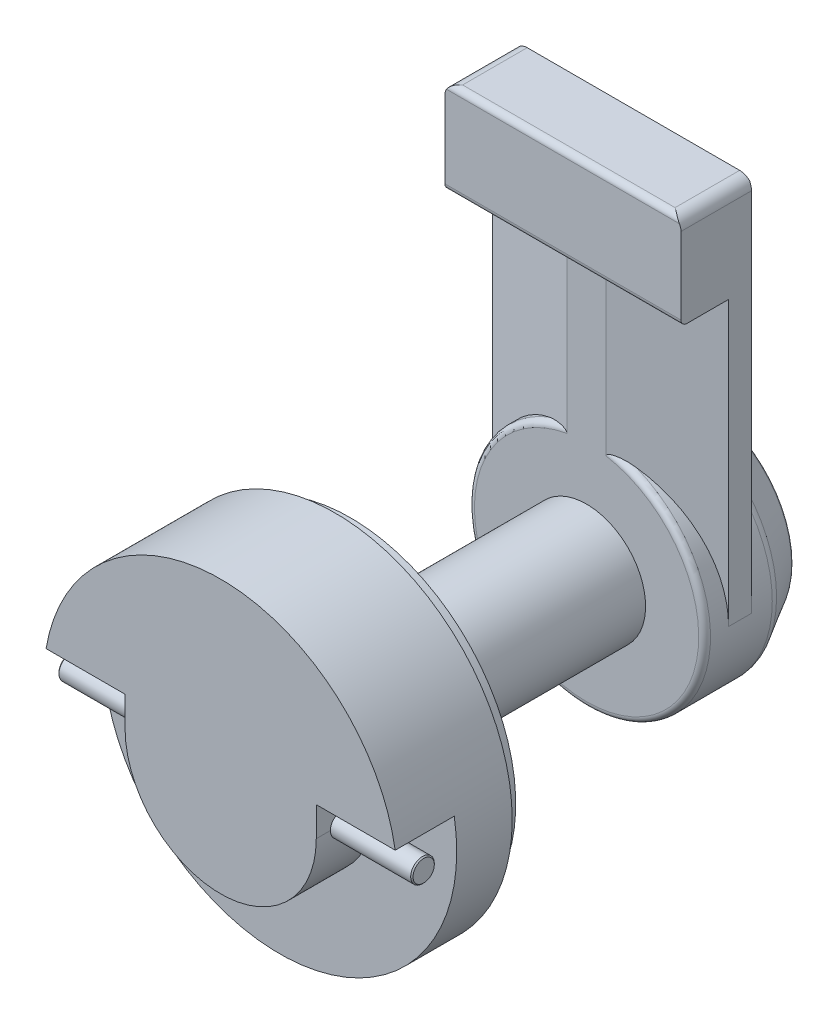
ISO-10303-21;
HEADER;
FILE_DESCRIPTION(('STEP AP214'),'2;1');
FILE_NAME('part.step','',(''),(''),'','','');
FILE_SCHEMA(('AUTOMOTIVE_DESIGN { 1 0 10303 214 1 1 1 1 }'));
ENDSEC;
DATA;
#1=APPLICATION_CONTEXT('core data for automotive mechanical design processes');
#2=APPLICATION_PROTOCOL_DEFINITION('international standard','automotive_design',2000,#1);
#3=PRODUCT_CONTEXT('',#1,'mechanical');
#4=PRODUCT('Part','Part','',(#3));
#5=PRODUCT_RELATED_PRODUCT_CATEGORY('part','',(#4));
#6=PRODUCT_DEFINITION_FORMATION('','',#4);
#7=PRODUCT_DEFINITION_CONTEXT('part definition',#1,'design');
#8=PRODUCT_DEFINITION('design','',#6,#7);
#9=PRODUCT_DEFINITION_SHAPE('','',#8);
#10=(LENGTH_UNIT() NAMED_UNIT(*) SI_UNIT(.MILLI.,.METRE.));
#11=(NAMED_UNIT(*) PLANE_ANGLE_UNIT() SI_UNIT($,.RADIAN.));
#12=(NAMED_UNIT(*) SI_UNIT($,.STERADIAN.) SOLID_ANGLE_UNIT());
#13=UNCERTAINTY_MEASURE_WITH_UNIT(LENGTH_MEASURE(1.E-05),#10,'distance_accuracy_value','');
#14=(GEOMETRIC_REPRESENTATION_CONTEXT(3) GLOBAL_UNCERTAINTY_ASSIGNED_CONTEXT((#13)) GLOBAL_UNIT_ASSIGNED_CONTEXT((#10,
#11,#12)) REPRESENTATION_CONTEXT('',''));
#15=CARTESIAN_POINT('',(0.,0.,0.));
#16=DIRECTION('',(0.,0.,1.));
#17=DIRECTION('',(1.,0.,0.));
#18=AXIS2_PLACEMENT_3D('',#15,#16,#17);
#19=CARTESIAN_POINT('',(0.,0.,-29.5));
#20=DIRECTION('',(0.,0.,1.));
#21=DIRECTION('',(1.,0.,0.));
#22=AXIS2_PLACEMENT_3D('',#19,#20,#21);
#23=PLANE('',#22);
#24=CARTESIAN_POINT('',(0.,0.,-29.5));
#25=DIRECTION('',(0.,0.,1.));
#26=DIRECTION('',(1.,0.,0.));
#27=AXIS2_PLACEMENT_3D('',#24,#25,#26);
#28=CIRCLE('',#27,7.6905989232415);
#29=CARTESIAN_POINT('',(7.6905989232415,0.,-29.5));
#30=VERTEX_POINT('',#29);
#31=EDGE_CURVE('E171',#30,#30,#28,.T.);
#32=ORIENTED_EDGE('',*,*,#31,.F.);
#33=EDGE_LOOP('',(#32));
#34=FACE_BOUND('',#33,.T.);
#35=ADVANCED_FACE('F14',(#34),#23,.F.);
#36=CARTESIAN_POINT('',(0.,0.,-29.));
#37=DIRECTION('',(0.,0.,1.));
#38=DIRECTION('',(1.,0.,0.));
#39=AXIS2_PLACEMENT_3D('',#36,#37,#38);
#40=TOROIDAL_SURFACE('',#39,7.6905989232,0.5);
#41=CARTESIAN_POINT('',(0.,0.,-29.2499999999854));
#42=DIRECTION('',(0.,0.,1.));
#43=DIRECTION('',(1.,0.,0.));
#44=AXIS2_PLACEMENT_3D('',#41,#42,#43);
#45=CIRCLE('',#44,8.12361162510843);
#46=CARTESIAN_POINT('',(8.12361162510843,0.,-29.2499999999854));
#47=VERTEX_POINT('',#46);
#48=EDGE_CURVE('E508',#47,#47,#45,.T.);
#49=ORIENTED_EDGE('',*,*,#48,.F.);
#50=EDGE_LOOP('',(#49));
#51=FACE_BOUND('',#50,.T.);
#52=ORIENTED_EDGE('',*,*,#31,.T.);
#53=EDGE_LOOP('',(#52));
#54=FACE_BOUND('',#53,.T.);
#55=ADVANCED_FACE('F524',(#51,#54),#40,.T.);
#56=CARTESIAN_POINT('',(-10.,32.,-23.97));
#57=DIRECTION('',(0.,0.,1.));
#58=DIRECTION('',(1.,0.,0.));
#59=AXIS2_PLACEMENT_3D('',#56,#57,#58);
#60=PLANE('',#59);
#61=DIRECTION('',(-1.,0.,0.));
#62=VECTOR('',#61,1.);
#63=CARTESIAN_POINT('',(0.,32.,-23.97));
#64=LINE('',#63,#62);
#65=CARTESIAN_POINT('',(9.,32.,-23.97));
#66=VERTEX_POINT('',#65);
#67=CARTESIAN_POINT('',(-9.,32.,-23.97));
#68=VERTEX_POINT('',#67);
#69=EDGE_CURVE('E173',#66,#68,#64,.T.);
#70=ORIENTED_EDGE('',*,*,#69,.F.);
#71=CARTESIAN_POINT('',(9.,31.,-23.97));
#72=DIRECTION('',(0.,0.,-1.));
#73=DIRECTION('',(-1.,0.,0.));
#74=AXIS2_PLACEMENT_3D('',#71,#72,#73);
#75=CIRCLE('',#74,1.);
#76=CARTESIAN_POINT('',(9.33791544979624,31.9411764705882,-23.97));
#77=VERTEX_POINT('',#76);
#78=EDGE_CURVE('E18',#77,#66,#75,.F.);
#79=ORIENTED_EDGE('',*,*,#78,.F.);
#80=DIRECTION('',(-1.,0.,0.));
#81=VECTOR('',#80,1.);
#82=CARTESIAN_POINT('',(-20.,31.9411764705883,-23.97));
#83=LINE('',#82,#81);
#84=CARTESIAN_POINT('',(-9.33791544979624,31.9411764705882,-23.97));
#85=VERTEX_POINT('',#84);
#86=EDGE_CURVE('E507',#85,#77,#83,.F.);
#87=ORIENTED_EDGE('',*,*,#86,.F.);
#88=CARTESIAN_POINT('',(-9.,31.,-23.97));
#89=DIRECTION('',(0.,0.,-1.));
#90=DIRECTION('',(-1.,0.,0.));
#91=AXIS2_PLACEMENT_3D('',#88,#89,#90);
#92=CIRCLE('',#91,1.);
#93=EDGE_CURVE('E170',#68,#85,#92,.F.);
#94=ORIENTED_EDGE('',*,*,#93,.F.);
#95=EDGE_LOOP('',(#70,#79,#87,#94));
#96=FACE_BOUND('',#95,.T.);
#97=ADVANCED_FACE('F174',(#96),#60,.F.);
#98=CARTESIAN_POINT('',(0.,0.,-26.2320508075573));
#99=DIRECTION('',(0.,0.,1.));
#100=DIRECTION('',(1.,0.,0.));
#101=AXIS2_PLACEMENT_3D('',#98,#99,#100);
#102=CONICAL_SURFACE('',#101,9.86602540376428,0.523598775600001);
#103=ORIENTED_EDGE('',*,*,#48,.T.);
#104=EDGE_LOOP('',(#103));
#105=FACE_BOUND('',#104,.T.);
#106=CARTESIAN_POINT('',(0.,0.,-26.2320508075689));
#107=DIRECTION('',(0.,0.,1.));
#108=DIRECTION('',(1.,0.,0.));
#109=AXIS2_PLACEMENT_3D('',#106,#107,#108);
#110=CIRCLE('',#109,9.86602540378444);
#111=CARTESIAN_POINT('',(9.86602540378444,0.,-26.2320508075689));
#112=VERTEX_POINT('',#111);
#113=EDGE_CURVE('E195',#112,#112,#110,.T.);
#114=ORIENTED_EDGE('',*,*,#113,.F.);
#115=EDGE_LOOP('',(#114));
#116=FACE_BOUND('',#115,.T.);
#117=ADVANCED_FACE('F986',(#105,#116),#102,.T.);
#118=CARTESIAN_POINT('',(1.65,32.,-26.));
#119=DIRECTION('',(0.,0.,1.));
#120=DIRECTION('',(1.,0.,0.));
#121=AXIS2_PLACEMENT_3D('',#118,#119,#120);
#122=PLANE('',#121);
#123=DIRECTION('',(0.,1.,0.));
#124=VECTOR('',#123,1.);
#125=CARTESIAN_POINT('',(1.65,32.,-26.));
#126=LINE('',#125,#124);
#127=CARTESIAN_POINT('',(1.65,20.,-26.));
#128=VERTEX_POINT('',#127);
#129=CARTESIAN_POINT('',(1.65,9.82585864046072,-26.));
#130=VERTEX_POINT('',#129);
#131=EDGE_CURVE('E480',#128,#130,#126,.F.);
#132=ORIENTED_EDGE('',*,*,#131,.T.);
#133=CARTESIAN_POINT('',(0.,0.,-26.));
#134=DIRECTION('',(0.,0.,1.));
#135=DIRECTION('',(1.,0.,0.));
#136=AXIS2_PLACEMENT_3D('',#133,#134,#135);
#137=CIRCLE('',#136,9.96343304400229);
#138=CARTESIAN_POINT('',(-1.65,9.82585864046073,-26.));
#139=VERTEX_POINT('',#138);
#140=EDGE_CURVE('E187',#139,#130,#137,.F.);
#141=ORIENTED_EDGE('',*,*,#140,.F.);
#142=DIRECTION('',(0.,1.,0.));
#143=VECTOR('',#142,1.);
#144=CARTESIAN_POINT('',(-1.65,32.,-26.));
#145=LINE('',#144,#143);
#146=CARTESIAN_POINT('',(-1.65,20.,-26.));
#147=VERTEX_POINT('',#146);
#148=EDGE_CURVE('E226',#139,#147,#145,.T.);
#149=ORIENTED_EDGE('',*,*,#148,.T.);
#150=DIRECTION('',(-1.,0.,0.));
#151=VECTOR('',#150,1.);
#152=CARTESIAN_POINT('',(-20.,20.,-26.));
#153=LINE('',#152,#151);
#154=EDGE_CURVE('E179',#128,#147,#153,.T.);
#155=ORIENTED_EDGE('',*,*,#154,.F.);
#156=EDGE_LOOP('',(#132,#141,#149,#155));
#157=FACE_BOUND('',#156,.T.);
#158=ADVANCED_FACE('F498',(#157),#122,.F.);
#159=CARTESIAN_POINT('',(-20.,20.,-26.));
#160=DIRECTION('',(0.,0.167595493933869,-0.985855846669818));
#161=DIRECTION('',(0.,-0.985855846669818,-0.167595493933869));
#162=AXIS2_PLACEMENT_3D('',#159,#160,#161);
#163=PLANE('',#162);
#164=DIRECTION('',(-0.567574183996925,-0.811677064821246,-0.137985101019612));
#165=VECTOR('',#164,1.);
#166=CARTESIAN_POINT('',(9.77970883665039,31.6261422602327,-24.0235558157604));
#167=LINE('',#166,#165);
#168=CARTESIAN_POINT('',(9.77970883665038,31.6261422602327,-24.0235558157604));
#169=VERTEX_POINT('',#168);
#170=EDGE_CURVE('E185',#169,#128,#167,.T.);
#171=ORIENTED_EDGE('',*,*,#170,.T.);
#172=ORIENTED_EDGE('',*,*,#154,.T.);
#173=DIRECTION('',(-0.567574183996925,0.811677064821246,0.137985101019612));
#174=VECTOR('',#173,1.);
#175=CARTESIAN_POINT('',(-1.65,20.,-26.));
#176=LINE('',#175,#174);
#177=CARTESIAN_POINT('',(-9.77970883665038,31.6261422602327,-24.0235558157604));
#178=VERTEX_POINT('',#177);
#179=EDGE_CURVE('E468',#147,#178,#176,.T.);
#180=ORIENTED_EDGE('',*,*,#179,.T.);
#181=CARTESIAN_POINT('',(-9.,31.,-24.13));
#182=DIRECTION('',(0.,0.167595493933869,-0.985855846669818));
#183=DIRECTION('',(0.,-0.985855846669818,-0.167595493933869));
#184=AXIS2_PLACEMENT_3D('',#181,#182,#183);
#185=ELLIPSE('',#184,1.01434708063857,1.);
#186=EDGE_CURVE('E505',#178,#85,#185,.T.);
#187=ORIENTED_EDGE('',*,*,#186,.T.);
#188=ORIENTED_EDGE('',*,*,#86,.T.);
#189=CARTESIAN_POINT('',(9.,31.,-24.13));
#190=DIRECTION('',(0.,0.167595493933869,-0.985855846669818));
#191=DIRECTION('',(0.,-0.985855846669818,-0.167595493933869));
#192=AXIS2_PLACEMENT_3D('',#189,#190,#191);
#193=ELLIPSE('',#192,1.01434708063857,1.);
#194=EDGE_CURVE('E169',#169,#77,#193,.F.);
#195=ORIENTED_EDGE('',*,*,#194,.F.);
#196=EDGE_LOOP('',(#171,#172,#180,#187,#188,#195));
#197=FACE_BOUND('',#196,.T.);
#198=ADVANCED_FACE('F490',(#197),#163,.T.);
#199=CARTESIAN_POINT('',(0.,32.,0.));
#200=DIRECTION('',(0.,1.,0.));
#201=DIRECTION('',(-1.,0.,0.));
#202=AXIS2_PLACEMENT_3D('',#199,#200,#201);
#203=PLANE('',#202);
#204=DIRECTION('',(-1.,0.,0.));
#205=VECTOR('',#204,1.);
#206=CARTESIAN_POINT('',(-10.,32.,-18.5));
#207=LINE('',#206,#205);
#208=CARTESIAN_POINT('',(9.,32.,-18.5));
#209=VERTEX_POINT('',#208);
#210=CARTESIAN_POINT('',(-9.,32.,-18.5));
#211=VERTEX_POINT('',#210);
#212=EDGE_CURVE('E178',#209,#211,#207,.T.);
#213=ORIENTED_EDGE('',*,*,#212,.F.);
#214=DIRECTION('',(0.,0.,-1.));
#215=VECTOR('',#214,1.);
#216=CARTESIAN_POINT('',(9.,32.,-61.5));
#217=LINE('',#216,#215);
#218=EDGE_CURVE('E167',#66,#209,#217,.F.);
#219=ORIENTED_EDGE('',*,*,#218,.F.);
#220=ORIENTED_EDGE('',*,*,#69,.T.);
#221=DIRECTION('',(0.,0.,-1.));
#222=VECTOR('',#221,1.);
#223=CARTESIAN_POINT('',(-9.,32.,-61.5));
#224=LINE('',#223,#222);
#225=EDGE_CURVE('E463',#211,#68,#224,.T.);
#226=ORIENTED_EDGE('',*,*,#225,.F.);
#227=EDGE_LOOP('',(#213,#219,#220,#226));
#228=FACE_BOUND('',#227,.T.);
#229=ADVANCED_FACE('F181',(#228),#203,.T.);
#230=CARTESIAN_POINT('',(-10.,31.5,-18.5));
#231=DIRECTION('',(-1.,0.,0.));
#232=DIRECTION('',(0.,0.,1.));
#233=AXIS2_PLACEMENT_3D('',#230,#231,#232);
#234=CYLINDRICAL_SURFACE('',#233,0.5);
#235=CARTESIAN_POINT('',(9.86602540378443,31.5,-18.));
#236=CARTESIAN_POINT('',(9.8552155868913,31.5187331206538,-18.0000007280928));
#237=CARTESIAN_POINT('',(9.84380559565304,31.5370821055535,-18.0010520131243));
#238=CARTESIAN_POINT('',(9.8199559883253,31.5728266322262,-18.0050063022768));
#239=CARTESIAN_POINT('',(9.80751905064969,31.5902244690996,-18.0079046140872));
#240=CARTESIAN_POINT('',(9.76919300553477,31.6403867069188,-18.0189042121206));
#241=CARTESIAN_POINT('',(9.74198170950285,31.671644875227,-18.0293243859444));
#242=CARTESIAN_POINT('',(9.67964579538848,31.7351378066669,-18.0571299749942));
#243=CARTESIAN_POINT('',(9.6440014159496,31.7664232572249,-18.0754643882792));
#244=CARTESIAN_POINT('',(9.57019040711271,31.8228339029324,-18.1165900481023));
#245=CARTESIAN_POINT('',(9.53200980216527,31.847920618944,-18.1394076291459));
#246=CARTESIAN_POINT('',(9.43829640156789,31.901032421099,-18.1978345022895));
#247=CARTESIAN_POINT('',(9.38200320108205,31.92612673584,-18.2348798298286));
#248=CARTESIAN_POINT('',(9.26794938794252,31.9653175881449,-18.3119899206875));
#249=CARTESIAN_POINT('',(9.2101907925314,31.9794284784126,-18.3520506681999));
#250=CARTESIAN_POINT('',(9.10326581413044,31.9958777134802,-18.4269901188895));
#251=CARTESIAN_POINT('',(9.05419676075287,31.9997336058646,-18.4616774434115));
#252=CARTESIAN_POINT('',(9.00344260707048,31.9999955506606,-18.4975657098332));
#253=CARTESIAN_POINT('',(9.00172127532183,31.9999999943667,-18.4987828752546));
#254=CARTESIAN_POINT('',(9.,32.,-18.5));
#255=B_SPLINE_CURVE_WITH_KNOTS('',3,(#235,#236,#237,#238,#239,#240,#241,#242,#243,#244,#245,
#246,#247,#248,#249,#250,#251,#252,#253,#254),.UNSPECIFIED.,.F.,.F.,(4,2,2,2,2,2,2,2,2,4),(0.,
0.0647962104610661,0.129428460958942,0.256901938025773,0.408670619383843,0.561358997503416,
0.775938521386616,0.99023716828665,1.17039020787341,1.17671477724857),.UNSPECIFIED.);
#256=CARTESIAN_POINT('',(9.86602540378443,31.5,-18.));
#257=VERTEX_POINT('',#256);
#258=EDGE_CURVE('E183',#209,#257,#255,.F.);
#259=ORIENTED_EDGE('',*,*,#258,.F.);
#260=ORIENTED_EDGE('',*,*,#212,.T.);
#261=CARTESIAN_POINT('',(-9.86602540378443,31.5,-18.));
#262=CARTESIAN_POINT('',(-9.8552155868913,31.5187331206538,-18.0000007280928));
#263=CARTESIAN_POINT('',(-9.84380559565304,31.5370821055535,-18.0010520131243));
#264=CARTESIAN_POINT('',(-9.8199559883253,31.5728266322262,-18.0050063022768));
#265=CARTESIAN_POINT('',(-9.80751905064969,31.5902244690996,-18.0079046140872));
#266=CARTESIAN_POINT('',(-9.76919300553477,31.6403867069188,-18.0189042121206));
#267=CARTESIAN_POINT('',(-9.74198170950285,31.671644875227,-18.0293243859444));
#268=CARTESIAN_POINT('',(-9.67964579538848,31.7351378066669,-18.0571299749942));
#269=CARTESIAN_POINT('',(-9.6440014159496,31.7664232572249,-18.0754643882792));
#270=CARTESIAN_POINT('',(-9.57019040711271,31.8228339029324,-18.1165900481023));
#271=CARTESIAN_POINT('',(-9.53200980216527,31.847920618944,-18.1394076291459));
#272=CARTESIAN_POINT('',(-9.43829640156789,31.901032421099,-18.1978345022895));
#273=CARTESIAN_POINT('',(-9.38200320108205,31.92612673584,-18.2348798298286));
#274=CARTESIAN_POINT('',(-9.26794938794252,31.9653175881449,-18.3119899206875));
#275=CARTESIAN_POINT('',(-9.2101907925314,31.9794284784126,-18.3520506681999));
#276=CARTESIAN_POINT('',(-9.10326581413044,31.9958777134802,-18.4269901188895));
#277=CARTESIAN_POINT('',(-9.05419676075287,31.9997336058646,-18.4616774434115));
#278=CARTESIAN_POINT('',(-9.00344260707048,31.9999955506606,-18.4975657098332));
#279=CARTESIAN_POINT('',(-9.00172127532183,31.9999999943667,-18.4987828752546));
#280=CARTESIAN_POINT('',(-9.,32.,-18.5));
#281=B_SPLINE_CURVE_WITH_KNOTS('',3,(#261,#262,#263,#264,#265,#266,#267,#268,#269,#270,#271,
#272,#273,#274,#275,#276,#277,#278,#279,#280),.UNSPECIFIED.,.F.,.F.,(4,2,2,2,2,2,2,2,2,4),(0.,
0.0647962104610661,0.129428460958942,0.256901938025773,0.408670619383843,0.561358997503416,
0.775938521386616,0.99023716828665,1.17039020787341,1.17671477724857),.UNSPECIFIED.);
#282=CARTESIAN_POINT('',(-9.86602540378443,31.5,-18.));
#283=VERTEX_POINT('',#282);
#284=EDGE_CURVE('E466',#283,#211,#281,.T.);
#285=ORIENTED_EDGE('',*,*,#284,.F.);
#286=DIRECTION('',(-1.,0.,0.));
#287=VECTOR('',#286,1.);
#288=CARTESIAN_POINT('',(-10.,31.5,-18.));
#289=LINE('',#288,#287);
#290=EDGE_CURVE('E460',#283,#257,#289,.F.);
#291=ORIENTED_EDGE('',*,*,#290,.T.);
#292=EDGE_LOOP('',(#259,#260,#285,#291));
#293=FACE_BOUND('',#292,.T.);
#294=ADVANCED_FACE('F203',(#293),#234,.T.);
#295=CARTESIAN_POINT('',(0.,0.,-25.7320508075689));
#296=DIRECTION('',(0.,0.,1.));
#297=DIRECTION('',(1.,0.,0.));
#298=AXIS2_PLACEMENT_3D('',#295,#296,#297);
#299=TOROIDAL_SURFACE('',#298,9.,1.);
#300=CARTESIAN_POINT('',(0.,0.,-25.7320508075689));
#301=DIRECTION('',(0.,0.,-1.));
#302=DIRECTION('',(-1.,0.,0.));
#303=AXIS2_PLACEMENT_3D('',#300,#301,#302);
#304=CIRCLE('',#303,10.);
#305=CARTESIAN_POINT('',(-2.75215554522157,9.61382545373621,-25.7320508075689));
#306=VERTEX_POINT('',#305);
#307=CARTESIAN_POINT('',(2.75215554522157,9.61382545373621,-25.7320508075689));
#308=VERTEX_POINT('',#307);
#309=EDGE_CURVE('E452',#306,#308,#304,.F.);
#310=ORIENTED_EDGE('',*,*,#309,.F.);
#311=CARTESIAN_POINT('',(-2.75215554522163,9.61382545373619,-25.7320508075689));
#312=CARTESIAN_POINT('',(-2.69198233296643,9.63105110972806,-25.746679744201));
#313=CARTESIAN_POINT('',(-2.63157162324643,9.64739992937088,-25.7613664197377));
#314=CARTESIAN_POINT('',(-2.51042305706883,9.67828941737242,-25.7908193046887));
#315=CARTESIAN_POINT('',(-2.44968592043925,9.69283307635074,-25.8055853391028));
#316=CARTESIAN_POINT('',(-2.32788236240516,9.72010406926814,-25.8351974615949));
#317=CARTESIAN_POINT('',(-2.26681626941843,9.73283295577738,-25.85004346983));
#318=CARTESIAN_POINT('',(-2.14434867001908,9.75645936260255,-25.8798170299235));
#319=CARTESIAN_POINT('',(-2.0829471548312,9.76735683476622,-25.8947445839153));
#320=CARTESIAN_POINT('',(-1.95980744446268,9.7872965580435,-25.924681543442));
#321=CARTESIAN_POINT('',(-1.8980690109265,9.79633725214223,-25.9396910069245));
#322=CARTESIAN_POINT('',(-1.77425134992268,9.81253090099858,-25.9697927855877));
#323=CARTESIAN_POINT('',(-1.71217171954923,9.81968059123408,-25.9848851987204));
#324=CARTESIAN_POINT('',(-1.65,9.82585864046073,-26.));
#325=B_SPLINE_CURVE_WITH_KNOTS('',3,(#311,#312,#313,#314,#315,#316,#317,#318,#319,#320,#321,
#322,#323,#324),.UNSPECIFIED.,.F.,.F.,(4,2,2,2,2,2,4),(0.,0.192825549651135,0.385327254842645,
0.577663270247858,0.770004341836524,0.962506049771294,1.15533794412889),.UNSPECIFIED.);
#326=EDGE_CURVE('E218',#306,#139,#325,.T.);
#327=ORIENTED_EDGE('',*,*,#326,.T.);
#328=ORIENTED_EDGE('',*,*,#140,.T.);
#329=CARTESIAN_POINT('',(1.65,9.82585864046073,-26.));
#330=CARTESIAN_POINT('',(1.71217171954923,9.81968059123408,-25.9848851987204));
#331=CARTESIAN_POINT('',(1.77425134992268,9.81253090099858,-25.9697927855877));
#332=CARTESIAN_POINT('',(1.8980690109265,9.79633725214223,-25.9396910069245));
#333=CARTESIAN_POINT('',(1.95980744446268,9.7872965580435,-25.924681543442));
#334=CARTESIAN_POINT('',(2.0829471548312,9.76735683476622,-25.8947445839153));
#335=CARTESIAN_POINT('',(2.14434867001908,9.75645936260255,-25.8798170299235));
#336=CARTESIAN_POINT('',(2.26681626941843,9.73283295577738,-25.85004346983));
#337=CARTESIAN_POINT('',(2.32788236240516,9.72010406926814,-25.8351974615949));
#338=CARTESIAN_POINT('',(2.44968592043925,9.69283307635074,-25.8055853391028));
#339=CARTESIAN_POINT('',(2.51042305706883,9.67828941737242,-25.7908193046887));
#340=CARTESIAN_POINT('',(2.63157162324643,9.64739992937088,-25.7613664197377));
#341=CARTESIAN_POINT('',(2.69198233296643,9.63105110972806,-25.746679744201));
#342=CARTESIAN_POINT('',(2.75215554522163,9.61382545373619,-25.7320508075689));
#343=B_SPLINE_CURVE_WITH_KNOTS('',3,(#329,#330,#331,#332,#333,#334,#335,#336,#337,#338,#339,
#340,#341,#342),.UNSPECIFIED.,.F.,.F.,(4,2,2,2,2,2,4),(0.,0.192831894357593,0.385333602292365,
0.57767467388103,0.770010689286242,0.96251239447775,1.15533794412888),.UNSPECIFIED.);
#344=EDGE_CURVE('E211',#130,#308,#343,.T.);
#345=ORIENTED_EDGE('',*,*,#344,.T.);
#346=EDGE_LOOP('',(#310,#327,#328,#345));
#347=FACE_BOUND('',#346,.T.);
#348=ORIENTED_EDGE('',*,*,#113,.T.);
#349=EDGE_LOOP('',(#348));
#350=FACE_BOUND('',#349,.T.);
#351=ADVANCED_FACE('F198',(#347,#350),#299,.T.);
#352=CARTESIAN_POINT('',(9.,31.,-61.5));
#353=DIRECTION('',(0.,0.,-1.));
#354=DIRECTION('',(-1.,0.,0.));
#355=AXIS2_PLACEMENT_3D('',#352,#353,#354);
#356=CYLINDRICAL_SURFACE('',#355,1.);
#357=CARTESIAN_POINT('',(9.,31.,-18.));
#358=DIRECTION('',(0.,0.,-1.));
#359=DIRECTION('',(-1.,0.,0.));
#360=AXIS2_PLACEMENT_3D('',#357,#358,#359);
#361=CIRCLE('',#360,1.);
#362=CARTESIAN_POINT('',(10.,31.,-18.));
#363=VERTEX_POINT('',#362);
#364=EDGE_CURVE('E462',#257,#363,#361,.T.);
#365=ORIENTED_EDGE('',*,*,#364,.T.);
#366=DIRECTION('',(0.,0.,1.));
#367=VECTOR('',#366,1.);
#368=CARTESIAN_POINT('',(10.,31.,-22.03));
#369=LINE('',#368,#367);
#370=CARTESIAN_POINT('',(10.,31.,-23.97));
#371=VERTEX_POINT('',#370);
#372=EDGE_CURVE('E191',#363,#371,#369,.F.);
#373=ORIENTED_EDGE('',*,*,#372,.T.);
#374=CARTESIAN_POINT('',(9.,31.,-24.2131137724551));
#375=DIRECTION('',(-0.23623279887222,0.,0.971696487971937));
#376=DIRECTION('',(-0.971696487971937,0.,-0.23623279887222));
#377=AXIS2_PLACEMENT_3D('',#374,#375,#376);
#378=ELLIPSE('',#377,1.02912793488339,1.);
#379=EDGE_CURVE('E227',#371,#169,#378,.T.);
#380=ORIENTED_EDGE('',*,*,#379,.T.);
#381=ORIENTED_EDGE('',*,*,#194,.T.);
#382=ORIENTED_EDGE('',*,*,#78,.T.);
#383=ORIENTED_EDGE('',*,*,#218,.T.);
#384=ORIENTED_EDGE('',*,*,#258,.T.);
#385=EDGE_LOOP('',(#365,#373,#380,#381,#382,#383,#384));
#386=FACE_BOUND('',#385,.T.);
#387=ADVANCED_FACE('F164',(#386),#356,.T.);
#388=CARTESIAN_POINT('',(10.,32.,-23.97));
#389=DIRECTION('',(-0.23623279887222,0.,0.971696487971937));
#390=DIRECTION('',(0.971696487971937,0.,0.23623279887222));
#391=AXIS2_PLACEMENT_3D('',#388,#389,#390);
#392=PLANE('',#391);
#393=DIRECTION('',(0.,1.,0.));
#394=VECTOR('',#393,1.);
#395=CARTESIAN_POINT('',(10.,32.,-23.97));
#396=LINE('',#395,#394);
#397=CARTESIAN_POINT('',(10.,0.,-23.97));
#398=VERTEX_POINT('',#397);
#399=EDGE_CURVE('E459',#371,#398,#396,.F.);
#400=ORIENTED_EDGE('',*,*,#399,.T.);
#401=CARTESIAN_POINT('',(0.,0.,-26.4011377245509));
#402=DIRECTION('',(-0.23623279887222,0.,0.971696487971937));
#403=DIRECTION('',(-0.971696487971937,0.,-0.23623279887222));
#404=AXIS2_PLACEMENT_3D('',#401,#402,#403);
#405=ELLIPSE('',#404,10.2912793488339,10.);
#406=EDGE_CURVE('E455',#308,#398,#405,.F.);
#407=ORIENTED_EDGE('',*,*,#406,.F.);
#408=ORIENTED_EDGE('',*,*,#344,.F.);
#409=ORIENTED_EDGE('',*,*,#131,.F.);
#410=ORIENTED_EDGE('',*,*,#170,.F.);
#411=ORIENTED_EDGE('',*,*,#379,.F.);
#412=EDGE_LOOP('',(#400,#407,#408,#409,#410,#411));
#413=FACE_BOUND('',#412,.T.);
#414=ADVANCED_FACE('F235',(#413),#392,.F.);
#415=CARTESIAN_POINT('',(-1.65,32.,-26.));
#416=DIRECTION('',(0.23623279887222,0.,0.971696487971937));
#417=DIRECTION('',(0.971696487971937,0.,-0.23623279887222));
#418=AXIS2_PLACEMENT_3D('',#415,#416,#417);
#419=PLANE('',#418);
#420=ORIENTED_EDGE('',*,*,#179,.F.);
#421=ORIENTED_EDGE('',*,*,#148,.F.);
#422=ORIENTED_EDGE('',*,*,#326,.F.);
#423=CARTESIAN_POINT('',(0.,0.,-26.4011377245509));
#424=DIRECTION('',(0.23623279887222,0.,0.971696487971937));
#425=DIRECTION('',(0.971696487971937,0.,-0.23623279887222));
#426=AXIS2_PLACEMENT_3D('',#423,#424,#425);
#427=ELLIPSE('',#426,10.2912793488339,10.);
#428=CARTESIAN_POINT('',(-10.,0.,-23.97));
#429=VERTEX_POINT('',#428);
#430=EDGE_CURVE('E456',#429,#306,#427,.F.);
#431=ORIENTED_EDGE('',*,*,#430,.F.);
#432=DIRECTION('',(0.,1.,0.));
#433=VECTOR('',#432,1.);
#434=CARTESIAN_POINT('',(-10.,32.,-23.97));
#435=LINE('',#434,#433);
#436=CARTESIAN_POINT('',(-10.,31.,-23.97));
#437=VERTEX_POINT('',#436);
#438=EDGE_CURVE('E450',#429,#437,#435,.T.);
#439=ORIENTED_EDGE('',*,*,#438,.T.);
#440=CARTESIAN_POINT('',(-9.,31.,-24.2131137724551));
#441=DIRECTION('',(0.23623279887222,0.,0.971696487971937));
#442=DIRECTION('',(0.971696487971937,0.,-0.23623279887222));
#443=AXIS2_PLACEMENT_3D('',#440,#441,#442);
#444=ELLIPSE('',#443,1.02912793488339,1.);
#445=EDGE_CURVE('E228',#178,#437,#444,.T.);
#446=ORIENTED_EDGE('',*,*,#445,.F.);
#447=EDGE_LOOP('',(#420,#421,#422,#431,#439,#446));
#448=FACE_BOUND('',#447,.T.);
#449=ADVANCED_FACE('F230',(#448),#419,.F.);
#450=CARTESIAN_POINT('',(-9.,31.,-61.5));
#451=DIRECTION('',(0.,0.,-1.));
#452=DIRECTION('',(-1.,0.,0.));
#453=AXIS2_PLACEMENT_3D('',#450,#451,#452);
#454=CYLINDRICAL_SURFACE('',#453,1.);
#455=ORIENTED_EDGE('',*,*,#93,.T.);
#456=ORIENTED_EDGE('',*,*,#186,.F.);
#457=ORIENTED_EDGE('',*,*,#445,.T.);
#458=DIRECTION('',(0.,0.,-1.));
#459=VECTOR('',#458,1.);
#460=CARTESIAN_POINT('',(-10.,31.,-23.97));
#461=LINE('',#460,#459);
#462=CARTESIAN_POINT('',(-10.,31.,-18.));
#463=VERTEX_POINT('',#462);
#464=EDGE_CURVE('E433',#437,#463,#461,.F.);
#465=ORIENTED_EDGE('',*,*,#464,.T.);
#466=CARTESIAN_POINT('',(-9.,31.,-18.));
#467=DIRECTION('',(0.,0.,-1.));
#468=DIRECTION('',(-1.,0.,0.));
#469=AXIS2_PLACEMENT_3D('',#466,#467,#468);
#470=CIRCLE('',#469,1.);
#471=EDGE_CURVE('E629',#463,#283,#470,.T.);
#472=ORIENTED_EDGE('',*,*,#471,.T.);
#473=ORIENTED_EDGE('',*,*,#284,.T.);
#474=ORIENTED_EDGE('',*,*,#225,.T.);
#475=EDGE_LOOP('',(#455,#456,#457,#465,#472,#473,#474));
#476=FACE_BOUND('',#475,.T.);
#477=ADVANCED_FACE('F234',(#476),#454,.T.);
#478=CARTESIAN_POINT('',(-10.,24.5,-18.));
#479=DIRECTION('',(0.,0.,-1.));
#480=DIRECTION('',(-1.,0.,0.));
#481=AXIS2_PLACEMENT_3D('',#478,#479,#480);
#482=PLANE('',#481);
#483=DIRECTION('',(0.,1.,0.));
#484=VECTOR('',#483,1.);
#485=CARTESIAN_POINT('',(-10.,32.,-18.));
#486=LINE('',#485,#484);
#487=CARTESIAN_POINT('',(-10.,24.5,-18.));
#488=VERTEX_POINT('',#487);
#489=EDGE_CURVE('E423',#463,#488,#486,.F.);
#490=ORIENTED_EDGE('',*,*,#489,.T.);
#491=DIRECTION('',(-1.,0.,0.));
#492=VECTOR('',#491,1.);
#493=CARTESIAN_POINT('',(-10.,24.5,-18.));
#494=LINE('',#493,#492);
#495=CARTESIAN_POINT('',(10.,24.5,-18.));
#496=VERTEX_POINT('',#495);
#497=EDGE_CURVE('E477',#496,#488,#494,.T.);
#498=ORIENTED_EDGE('',*,*,#497,.F.);
#499=DIRECTION('',(0.,1.,0.));
#500=VECTOR('',#499,1.);
#501=CARTESIAN_POINT('',(10.,32.,-18.));
#502=LINE('',#501,#500);
#503=EDGE_CURVE('E443',#496,#363,#502,.T.);
#504=ORIENTED_EDGE('',*,*,#503,.T.);
#505=ORIENTED_EDGE('',*,*,#364,.F.);
#506=ORIENTED_EDGE('',*,*,#290,.F.);
#507=ORIENTED_EDGE('',*,*,#471,.F.);
#508=EDGE_LOOP('',(#490,#498,#504,#505,#506,#507));
#509=FACE_BOUND('',#508,.T.);
#510=ADVANCED_FACE('F648',(#509),#482,.F.);
#511=CARTESIAN_POINT('',(0.,0.,11.));
#512=DIRECTION('',(0.,0.,-1.));
#513=DIRECTION('',(-1.,0.,0.));
#514=AXIS2_PLACEMENT_3D('',#511,#512,#513);
#515=CYLINDRICAL_SURFACE('',#514,10.);
#516=CARTESIAN_POINT('',(0.,0.,-19.5988622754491));
#517=DIRECTION('',(0.23623279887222,0.,-0.971696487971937));
#518=DIRECTION('',(-0.971696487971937,0.,-0.23623279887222));
#519=AXIS2_PLACEMENT_3D('',#516,#517,#518);
#520=ELLIPSE('',#519,10.2912793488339,10.);
#521=CARTESIAN_POINT('',(-3.70665024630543,9.28766622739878,-20.5));
#522=VERTEX_POINT('',#521);
#523=CARTESIAN_POINT('',(-10.,0.,-22.03));
#524=VERTEX_POINT('',#523);
#525=EDGE_CURVE('E367',#522,#524,#520,.F.);
#526=ORIENTED_EDGE('',*,*,#525,.T.);
#527=DIRECTION('',(0.,0.,-1.));
#528=VECTOR('',#527,1.);
#529=CARTESIAN_POINT('',(-10.,0.,-23.97));
#530=LINE('',#529,#528);
#531=EDGE_CURVE('E447',#524,#429,#530,.T.);
#532=ORIENTED_EDGE('',*,*,#531,.T.);
#533=ORIENTED_EDGE('',*,*,#430,.T.);
#534=ORIENTED_EDGE('',*,*,#309,.T.);
#535=ORIENTED_EDGE('',*,*,#406,.T.);
#536=DIRECTION('',(0.,0.,1.));
#537=VECTOR('',#536,1.);
#538=CARTESIAN_POINT('',(10.,0.,-22.03));
#539=LINE('',#538,#537);
#540=CARTESIAN_POINT('',(10.,0.,-22.03));
#541=VERTEX_POINT('',#540);
#542=EDGE_CURVE('E457',#398,#541,#539,.T.);
#543=ORIENTED_EDGE('',*,*,#542,.T.);
#544=CARTESIAN_POINT('',(0.,0.,-19.5988622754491));
#545=DIRECTION('',(-0.23623279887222,0.,-0.971696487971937));
#546=DIRECTION('',(0.971696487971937,0.,-0.23623279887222));
#547=AXIS2_PLACEMENT_3D('',#544,#545,#546);
#548=ELLIPSE('',#547,10.2912793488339,10.);
#549=CARTESIAN_POINT('',(3.70665024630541,9.28766622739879,-20.5));
#550=VERTEX_POINT('',#549);
#551=EDGE_CURVE('E422',#541,#550,#548,.F.);
#552=ORIENTED_EDGE('',*,*,#551,.T.);
#553=CARTESIAN_POINT('',(0.,0.,-20.5));
#554=DIRECTION('',(0.,0.,1.));
#555=DIRECTION('',(1.,0.,0.));
#556=AXIS2_PLACEMENT_3D('',#553,#554,#555);
#557=CIRCLE('',#556,10.);
#558=EDGE_CURVE('E383',#522,#550,#557,.T.);
#559=ORIENTED_EDGE('',*,*,#558,.F.);
#560=EDGE_LOOP('',(#526,#532,#533,#534,#535,#543,#552,#559));
#561=FACE_BOUND('',#560,.T.);
#562=ADVANCED_FACE('F660',(#561),#515,.T.);
#563=CARTESIAN_POINT('',(-10.,24.5,-18.5));
#564=DIRECTION('',(-1.,0.,0.));
#565=DIRECTION('',(0.,0.,1.));
#566=AXIS2_PLACEMENT_3D('',#563,#564,#565);
#567=CYLINDRICAL_SURFACE('',#566,0.5);
#568=CARTESIAN_POINT('',(-10.,24.5,-18.5));
#569=DIRECTION('',(-1.,0.,0.));
#570=DIRECTION('',(0.,0.,1.));
#571=AXIS2_PLACEMENT_3D('',#568,#569,#570);
#572=CIRCLE('',#571,0.5);
#573=CARTESIAN_POINT('',(-10.,24.,-18.5));
#574=VERTEX_POINT('',#573);
#575=EDGE_CURVE('E451',#488,#574,#572,.F.);
#576=ORIENTED_EDGE('',*,*,#575,.T.);
#577=DIRECTION('',(-1.,0.,0.));
#578=VECTOR('',#577,1.);
#579=CARTESIAN_POINT('',(-10.,24.,-18.5));
#580=LINE('',#579,#578);
#581=CARTESIAN_POINT('',(10.,24.,-18.5));
#582=VERTEX_POINT('',#581);
#583=EDGE_CURVE('E366',#574,#582,#580,.F.);
#584=ORIENTED_EDGE('',*,*,#583,.T.);
#585=CARTESIAN_POINT('',(10.,24.5,-18.5));
#586=DIRECTION('',(-1.,0.,0.));
#587=DIRECTION('',(0.,0.,1.));
#588=AXIS2_PLACEMENT_3D('',#585,#586,#587);
#589=CIRCLE('',#588,0.5);
#590=EDGE_CURVE('E446',#582,#496,#589,.T.);
#591=ORIENTED_EDGE('',*,*,#590,.T.);
#592=ORIENTED_EDGE('',*,*,#497,.T.);
#593=EDGE_LOOP('',(#576,#584,#591,#592));
#594=FACE_BOUND('',#593,.T.);
#595=ADVANCED_FACE('F767',(#594),#567,.T.);
#596=CARTESIAN_POINT('',(10.,32.,-22.03));
#597=DIRECTION('',(-1.,0.,0.));
#598=DIRECTION('',(0.,0.,1.));
#599=AXIS2_PLACEMENT_3D('',#596,#597,#598);
#600=PLANE('',#599);
#601=ORIENTED_EDGE('',*,*,#399,.F.);
#602=ORIENTED_EDGE('',*,*,#372,.F.);
#603=ORIENTED_EDGE('',*,*,#503,.F.);
#604=ORIENTED_EDGE('',*,*,#590,.F.);
#605=DIRECTION('',(0.,0.,1.));
#606=VECTOR('',#605,1.);
#607=CARTESIAN_POINT('',(10.,24.,-23.97));
#608=LINE('',#607,#606);
#609=CARTESIAN_POINT('',(10.,24.,-22.03));
#610=VERTEX_POINT('',#609);
#611=EDGE_CURVE('E428',#582,#610,#608,.F.);
#612=ORIENTED_EDGE('',*,*,#611,.T.);
#613=DIRECTION('',(0.,1.,0.));
#614=VECTOR('',#613,1.);
#615=CARTESIAN_POINT('',(10.,32.,-22.03));
#616=LINE('',#615,#614);
#617=EDGE_CURVE('E414',#610,#541,#616,.F.);
#618=ORIENTED_EDGE('',*,*,#617,.T.);
#619=ORIENTED_EDGE('',*,*,#542,.F.);
#620=EDGE_LOOP('',(#601,#602,#603,#604,#612,#618,#619));
#621=FACE_BOUND('',#620,.T.);
#622=ADVANCED_FACE('F657',(#621),#600,.F.);
#623=CARTESIAN_POINT('',(-10.,32.,-23.97));
#624=DIRECTION('',(1.,0.,0.));
#625=DIRECTION('',(0.,0.,-1.));
#626=AXIS2_PLACEMENT_3D('',#623,#624,#625);
#627=PLANE('',#626);
#628=ORIENTED_EDGE('',*,*,#464,.F.);
#629=ORIENTED_EDGE('',*,*,#438,.F.);
#630=ORIENTED_EDGE('',*,*,#531,.F.);
#631=DIRECTION('',(0.,1.,0.));
#632=VECTOR('',#631,1.);
#633=CARTESIAN_POINT('',(-10.,32.,-22.03));
#634=LINE('',#633,#632);
#635=CARTESIAN_POINT('',(-10.,24.,-22.03));
#636=VERTEX_POINT('',#635);
#637=EDGE_CURVE('E363',#524,#636,#634,.T.);
#638=ORIENTED_EDGE('',*,*,#637,.T.);
#639=DIRECTION('',(0.,0.,1.));
#640=VECTOR('',#639,1.);
#641=CARTESIAN_POINT('',(-10.,24.,-23.97));
#642=LINE('',#641,#640);
#643=EDGE_CURVE('E360',#636,#574,#642,.T.);
#644=ORIENTED_EDGE('',*,*,#643,.T.);
#645=ORIENTED_EDGE('',*,*,#575,.F.);
#646=ORIENTED_EDGE('',*,*,#489,.F.);
#647=EDGE_LOOP('',(#628,#629,#630,#638,#644,#645,#646));
#648=FACE_BOUND('',#647,.T.);
#649=ADVANCED_FACE('F644',(#648),#627,.F.);
#650=CARTESIAN_POINT('',(1.65,32.,-20.));
#651=DIRECTION('',(-0.23623279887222,0.,-0.971696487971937));
#652=DIRECTION('',(-0.971696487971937,0.,0.23623279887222));
#653=AXIS2_PLACEMENT_3D('',#650,#651,#652);
#654=PLANE('',#653);
#655=DIRECTION('',(0.,1.,0.));
#656=VECTOR('',#655,1.);
#657=CARTESIAN_POINT('',(1.65,9.5,-20.));
#658=LINE('',#657,#656);
#659=CARTESIAN_POINT('',(1.65,24.,-20.));
#660=VERTEX_POINT('',#659);
#661=CARTESIAN_POINT('',(1.65,9.35561328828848,-20.));
#662=VERTEX_POINT('',#661);
#663=EDGE_CURVE('E357',#660,#662,#658,.F.);
#664=ORIENTED_EDGE('',*,*,#663,.T.);
#665=CARTESIAN_POINT('',(3.70665024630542,9.28766622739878,-20.5));
#666=CARTESIAN_POINT('',(3.63070652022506,9.31796073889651,-20.4815370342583));
#667=CARTESIAN_POINT('',(3.5540470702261,9.34638699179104,-20.4629000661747));
#668=CARTESIAN_POINT('',(3.399361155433,9.39926197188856,-20.4252937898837));
#669=CARTESIAN_POINT('',(3.32133341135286,9.42370672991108,-20.4063241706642));
#670=CARTESIAN_POINT('',(3.16401298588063,9.46834879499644,-20.3680774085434));
#671=CARTESIAN_POINT('',(3.08471864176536,9.48853992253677,-20.3487998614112));
#672=CARTESIAN_POINT('',(2.925163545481,9.52421070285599,-20.3100098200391));
#673=CARTESIAN_POINT('',(2.84490329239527,9.53969268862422,-20.2904974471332));
#674=CARTESIAN_POINT('',(2.70497648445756,9.56192485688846,-20.2564793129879));
#675=CARTESIAN_POINT('',(2.64549322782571,9.56990184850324,-20.2420181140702));
#676=CARTESIAN_POINT('',(2.52620752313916,9.58259121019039,-20.2130181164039));
#677=CARTESIAN_POINT('',(2.46640520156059,9.58730478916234,-20.1984793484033));
#678=CARTESIAN_POINT('',(2.365319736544,9.5919969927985,-20.1739040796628));
#679=CARTESIAN_POINT('',(2.32408082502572,9.59299416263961,-20.1638783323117));
#680=CARTESIAN_POINT('',(2.24160918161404,9.5928501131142,-20.1438283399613));
#681=CARTESIAN_POINT('',(2.20037645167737,9.59170954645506,-20.1338040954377));
#682=CARTESIAN_POINT('',(2.1304201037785,9.58754684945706,-20.1167967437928));
#683=CARTESIAN_POINT('',(2.10165920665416,9.58519278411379,-20.1098045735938));
#684=CARTESIAN_POINT('',(2.04424863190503,9.57894153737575,-20.0958472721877));
#685=CARTESIAN_POINT('',(2.01559916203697,9.57504223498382,-20.0888821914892));
#686=CARTESIAN_POINT('',(1.95646135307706,9.56494336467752,-20.0745049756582));
#687=CARTESIAN_POINT('',(1.92599696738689,9.55859271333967,-20.0670986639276));
#688=CARTESIAN_POINT('',(1.86584779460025,9.54286678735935,-20.0524755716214));
#689=CARTESIAN_POINT('',(1.83616079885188,9.53350139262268,-20.0452582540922));
#690=CARTESIAN_POINT('',(1.79463316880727,9.51663261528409,-20.0351623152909));
#691=CARTESIAN_POINT('',(1.78207963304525,9.51100734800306,-20.0321103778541));
#692=CARTESIAN_POINT('',(1.75754029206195,9.49858631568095,-20.0261445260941));
#693=CARTESIAN_POINT('',(1.74555364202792,9.49179236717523,-20.0232304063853));
#694=CARTESIAN_POINT('',(1.72226970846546,9.47654554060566,-20.0175697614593));
#695=CARTESIAN_POINT('',(1.71099034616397,9.46806299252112,-20.0148275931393));
#696=CARTESIAN_POINT('',(1.69020281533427,9.44905992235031,-20.0097738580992));
#697=CARTESIAN_POINT('',(1.6806815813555,9.43855572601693,-20.0074591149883));
#698=CARTESIAN_POINT('',(1.66883190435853,9.42114805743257,-20.0045782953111));
#699=CARTESIAN_POINT('',(1.66530290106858,9.41511555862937,-20.0037203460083));
#700=CARTESIAN_POINT('',(1.65924060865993,9.40254351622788,-20.0022465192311));
#701=CARTESIAN_POINT('',(1.65670551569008,9.39600491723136,-20.0016302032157));
#702=CARTESIAN_POINT('',(1.6531796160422,9.3838474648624,-20.000773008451));
#703=CARTESIAN_POINT('',(1.65198681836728,9.37829015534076,-20.0004830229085));
#704=CARTESIAN_POINT('',(1.65038933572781,9.36702719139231,-20.0000946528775));
#705=CARTESIAN_POINT('',(1.64998881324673,9.36132091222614,-19.9999972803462));
#706=CARTESIAN_POINT('',(1.65,9.35561328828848,-20.));
#707=B_SPLINE_CURVE_WITH_KNOTS('',3,(#665,#666,#667,#668,#669,#670,#671,#672,#673,#674,#675,
#676,#677,#678,#679,#680,#681,#682,#683,#684,#685,#686,#687,#688,#689,#690,#691,#692,#693,#694,
#695,#696,#697,#698,#699,#700,#701,#702,#703,#704,#705,#706),.UNSPECIFIED.,.F.,.F.,(4,2,2,2,2,2,
2,2,2,2,2,2,2,2,2,2,2,2,2,2,4),(0.,0.251458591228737,0.503166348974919,0.755237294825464,
1.00718315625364,1.19231343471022,1.37737509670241,1.50468946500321,1.63196496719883,
1.72101095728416,1.8101795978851,1.90606174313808,2.00163280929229,2.04386330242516,
2.08602873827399,2.12901350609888,2.17166470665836,2.19271325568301,2.2137234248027,
2.23073827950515,2.24784229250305),.UNSPECIFIED.);
#708=EDGE_CURVE('E608',#550,#662,#707,.T.);
#709=ORIENTED_EDGE('',*,*,#708,.F.);
#710=ORIENTED_EDGE('',*,*,#551,.F.);
#711=ORIENTED_EDGE('',*,*,#617,.F.);
#712=DIRECTION('',(-0.971696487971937,0.,0.236232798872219));
#713=VECTOR('',#712,1.);
#714=CARTESIAN_POINT('',(10.,24.,-22.03));
#715=LINE('',#714,#713);
#716=EDGE_CURVE('E373',#610,#660,#715,.T.);
#717=ORIENTED_EDGE('',*,*,#716,.T.);
#718=EDGE_LOOP('',(#664,#709,#710,#711,#717));
#719=FACE_BOUND('',#718,.T.);
#720=ADVANCED_FACE('F392',(#719),#654,.F.);
#721=CARTESIAN_POINT('',(0.,0.,-20.5));
#722=DIRECTION('',(0.,0.,1.));
#723=DIRECTION('',(1.,0.,0.));
#724=AXIS2_PLACEMENT_3D('',#721,#722,#723);
#725=TOROIDAL_SURFACE('',#724,9.5,0.5);
#726=ORIENTED_EDGE('',*,*,#558,.T.);
#727=ORIENTED_EDGE('',*,*,#708,.T.);
#728=CARTESIAN_POINT('',(0.,0.,-20.));
#729=DIRECTION('',(0.,0.,-1.));
#730=DIRECTION('',(0.173684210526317,0.984801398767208,0.));
#731=AXIS2_PLACEMENT_3D('',#728,#729,#730);
#732=CIRCLE('',#731,9.5);
#733=CARTESIAN_POINT('',(-1.65,9.35561328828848,-20.));
#734=VERTEX_POINT('',#733);
#735=EDGE_CURVE('E354',#662,#734,#732,.T.);
#736=ORIENTED_EDGE('',*,*,#735,.T.);
#737=CARTESIAN_POINT('',(-1.65,9.35561328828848,-20.));
#738=CARTESIAN_POINT('',(-1.64997730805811,9.36234295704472,-19.9999944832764));
#739=CARTESIAN_POINT('',(-1.65054039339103,9.36906883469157,-20.0001313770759));
#740=CARTESIAN_POINT('',(-1.65276421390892,9.38227016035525,-20.0006720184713));
#741=CARTESIAN_POINT('',(-1.6544159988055,9.38874719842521,-20.0010735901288));
#742=CARTESIAN_POINT('',(-1.65874452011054,9.40132166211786,-20.0021259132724));
#743=CARTESIAN_POINT('',(-1.66142097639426,9.40741919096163,-20.0027765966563));
#744=CARTESIAN_POINT('',(-1.6676240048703,9.41914175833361,-20.0042846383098));
#745=CARTESIAN_POINT('',(-1.67115209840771,9.42476592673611,-20.0051423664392));
#746=CARTESIAN_POINT('',(-1.68121980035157,9.43877363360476,-20.0075899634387));
#747=CARTESIAN_POINT('',(-1.68828576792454,9.44675443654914,-20.0093077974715));
#748=CARTESIAN_POINT('',(-1.70350915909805,9.46152538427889,-20.0130088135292));
#749=CARTESIAN_POINT('',(-1.71167017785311,9.46831142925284,-20.0149928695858));
#750=CARTESIAN_POINT('',(-1.73648192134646,9.48668270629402,-20.0210249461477));
#751=CARTESIAN_POINT('',(-1.75404258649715,9.49694760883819,-20.0252941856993));
#752=CARTESIAN_POINT('',(-1.79029132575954,9.51501457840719,-20.0341067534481));
#753=CARTESIAN_POINT('',(-1.80898237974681,9.52280976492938,-20.0386508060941));
#754=CARTESIAN_POINT('',(-1.85749940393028,9.54047326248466,-20.0504459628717));
#755=CARTESIAN_POINT('',(-1.88774969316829,9.54909224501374,-20.0578002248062));
#756=CARTESIAN_POINT('',(-1.94889650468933,9.56350147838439,-20.0726658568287));
#757=CARTESIAN_POINT('',(-1.97979430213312,9.56928546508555,-20.0801775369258));
#758=CARTESIAN_POINT('',(-2.04203550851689,9.5787453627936,-20.0953092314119));
#759=CARTESIAN_POINT('',(-2.0733803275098,9.58241126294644,-20.1029295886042));
#760=CARTESIAN_POINT('',(-2.13617511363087,9.58803025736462,-20.1181958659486));
#761=CARTESIAN_POINT('',(-2.16762494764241,9.58998502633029,-20.1258417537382));
#762=CARTESIAN_POINT('',(-2.24452895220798,9.59302487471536,-20.1445381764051));
#763=CARTESIAN_POINT('',(-2.29001170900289,9.59334043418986,-20.1555956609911));
#764=CARTESIAN_POINT('',(-2.38093704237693,9.59154999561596,-20.1777008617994));
#765=CARTESIAN_POINT('',(-2.42637959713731,9.58944307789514,-20.1887485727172));
#766=CARTESIAN_POINT('',(-2.56263682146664,9.58000634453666,-20.2218745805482));
#767=CARTESIAN_POINT('',(-2.65325375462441,9.56955775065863,-20.2439048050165));
#768=CARTESIAN_POINT('',(-2.83344404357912,9.54197597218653,-20.287711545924));
#769=CARTESIAN_POINT('',(-2.9230177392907,9.52484503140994,-20.3094881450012));
#770=CARTESIAN_POINT('',(-3.1008394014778,9.48476884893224,-20.3527190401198));
#771=CARTESIAN_POINT('',(-3.18908848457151,9.46182883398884,-20.3741736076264));
#772=CARTESIAN_POINT('',(-3.34953541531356,9.41494506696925,-20.4131804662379));
#773=CARTESIAN_POINT('',(-3.42195763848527,9.39180548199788,-20.4307873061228));
#774=CARTESIAN_POINT('',(-3.56533662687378,9.34219151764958,-20.4656447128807));
#775=CARTESIAN_POINT('',(-3.63629869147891,9.31573337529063,-20.482896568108));
#776=CARTESIAN_POINT('',(-3.70665024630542,9.28766622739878,-20.5));
#777=B_SPLINE_CURVE_WITH_KNOTS('',3,(#737,#738,#739,#740,#741,#742,#743,#744,#745,#746,#747,
#748,#749,#750,#751,#752,#753,#754,#755,#756,#757,#758,#759,#760,#761,#762,#763,#764,#765,#766,
#767,#768,#769,#770,#771,#772,#773,#774,#775,#776),.UNSPECIFIED.,.F.,.F.,(4,2,2,2,2,2,2,2,2,2,2,
2,2,2,2,2,2,2,2,4),(0.,0.0201553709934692,0.0401470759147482,0.060133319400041,
0.0801555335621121,0.112358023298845,0.14466894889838,0.20667173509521,0.268845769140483,
0.36551505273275,0.46239698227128,0.559733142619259,0.656973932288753,0.79731578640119,
0.937710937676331,1.2188928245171,1.49998037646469,1.78081591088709,2.01485672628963,
2.24779410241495),.UNSPECIFIED.);
#778=EDGE_CURVE('E606',#734,#522,#777,.T.);
#779=ORIENTED_EDGE('',*,*,#778,.T.);
#780=EDGE_LOOP('',(#726,#727,#736,#779));
#781=FACE_BOUND('',#780,.T.);
#782=ADVANCED_FACE('F386',(#781),#725,.T.);
#783=CARTESIAN_POINT('',(-10.,32.,-22.03));
#784=DIRECTION('',(0.23623279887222,0.,-0.971696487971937));
#785=DIRECTION('',(-0.971696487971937,0.,-0.23623279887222));
#786=AXIS2_PLACEMENT_3D('',#783,#784,#785);
#787=PLANE('',#786);
#788=ORIENTED_EDGE('',*,*,#637,.F.);
#789=ORIENTED_EDGE('',*,*,#525,.F.);
#790=ORIENTED_EDGE('',*,*,#778,.F.);
#791=DIRECTION('',(0.,1.,0.));
#792=VECTOR('',#791,1.);
#793=CARTESIAN_POINT('',(-1.65,9.5,-20.));
#794=LINE('',#793,#792);
#795=CARTESIAN_POINT('',(-1.65,24.,-20.));
#796=VERTEX_POINT('',#795);
#797=EDGE_CURVE('E345',#734,#796,#794,.T.);
#798=ORIENTED_EDGE('',*,*,#797,.T.);
#799=DIRECTION('',(-0.971696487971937,0.,-0.236232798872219));
#800=VECTOR('',#799,1.);
#801=CARTESIAN_POINT('',(-1.65,24.,-20.));
#802=LINE('',#801,#800);
#803=EDGE_CURVE('E370',#796,#636,#802,.T.);
#804=ORIENTED_EDGE('',*,*,#803,.T.);
#805=EDGE_LOOP('',(#788,#789,#790,#798,#804));
#806=FACE_BOUND('',#805,.T.);
#807=ADVANCED_FACE('F391',(#806),#787,.F.);
#808=CARTESIAN_POINT('',(-10.,24.,-23.97));
#809=DIRECTION('',(0.,1.,0.));
#810=DIRECTION('',(-1.,0.,0.));
#811=AXIS2_PLACEMENT_3D('',#808,#809,#810);
#812=PLANE('',#811);
#813=ORIENTED_EDGE('',*,*,#803,.F.);
#814=DIRECTION('',(-1.,0.,0.));
#815=VECTOR('',#814,1.);
#816=CARTESIAN_POINT('',(0.,24.,-20.));
#817=LINE('',#816,#815);
#818=EDGE_CURVE('E353',#796,#660,#817,.F.);
#819=ORIENTED_EDGE('',*,*,#818,.T.);
#820=ORIENTED_EDGE('',*,*,#716,.F.);
#821=ORIENTED_EDGE('',*,*,#611,.F.);
#822=ORIENTED_EDGE('',*,*,#583,.F.);
#823=ORIENTED_EDGE('',*,*,#643,.F.);
#824=EDGE_LOOP('',(#813,#819,#820,#821,#822,#823));
#825=FACE_BOUND('',#824,.T.);
#826=ADVANCED_FACE('F739',(#825),#812,.F.);
#827=CARTESIAN_POINT('',(15.,0.,8.8));
#828=DIRECTION('',(-1.,0.,0.));
#829=DIRECTION('',(0.,0.,1.));
#830=AXIS2_PLACEMENT_3D('',#827,#828,#829);
#831=PLANE('',#830);
#832=CARTESIAN_POINT('',(14.9999999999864,0.,8.8));
#833=DIRECTION('',(-1.,0.,0.));
#834=DIRECTION('',(0.,0.,1.));
#835=AXIS2_PLACEMENT_3D('',#832,#833,#834);
#836=CIRCLE('',#835,0.900000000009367);
#837=CARTESIAN_POINT('',(14.9999999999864,0.,9.70000000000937));
#838=VERTEX_POINT('',#837);
#839=EDGE_CURVE('E378',#838,#838,#836,.T.);
#840=ORIENTED_EDGE('',*,*,#839,.F.);
#841=EDGE_LOOP('',(#840));
#842=FACE_BOUND('',#841,.T.);
#843=ADVANCED_FACE('F734',(#842),#831,.F.);
#844=CARTESIAN_POINT('',(-15.,0.,9.7));
#845=DIRECTION('',(1.,0.,0.));
#846=DIRECTION('',(0.,0.,-1.));
#847=AXIS2_PLACEMENT_3D('',#844,#845,#846);
#848=PLANE('',#847);
#849=CARTESIAN_POINT('',(-14.9999999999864,0.,8.8));
#850=DIRECTION('',(1.,0.,0.));
#851=DIRECTION('',(0.,1.,0.));
#852=AXIS2_PLACEMENT_3D('',#849,#850,#851);
#853=CIRCLE('',#852,0.900000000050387);
#854=CARTESIAN_POINT('',(-14.9999999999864,0.900000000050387,8.8));
#855=VERTEX_POINT('',#854);
#856=EDGE_CURVE('E598',#855,#855,#853,.T.);
#857=ORIENTED_EDGE('',*,*,#856,.F.);
#858=EDGE_LOOP('',(#857));
#859=FACE_BOUND('',#858,.T.);
#860=ADVANCED_FACE('F335',(#859),#848,.F.);
#861=CARTESIAN_POINT('',(0.,9.5,-20.));
#862=DIRECTION('',(0.,0.,-1.));
#863=DIRECTION('',(-1.,0.,0.));
#864=AXIS2_PLACEMENT_3D('',#861,#862,#863);
#865=PLANE('',#864);
#866=ORIENTED_EDGE('',*,*,#797,.F.);
#867=ORIENTED_EDGE('',*,*,#735,.F.);
#868=ORIENTED_EDGE('',*,*,#663,.F.);
#869=ORIENTED_EDGE('',*,*,#818,.F.);
#870=EDGE_LOOP('',(#866,#867,#868,#869));
#871=FACE_BOUND('',#870,.T.);
#872=CARTESIAN_POINT('',(0.,0.,-20.));
#873=DIRECTION('',(0.,0.,-1.));
#874=DIRECTION('',(-1.,0.,0.));
#875=AXIS2_PLACEMENT_3D('',#872,#873,#874);
#876=CIRCLE('',#875,5.);
#877=CARTESIAN_POINT('',(-5.,0.,-20.));
#878=VERTEX_POINT('',#877);
#879=EDGE_CURVE('E594',#878,#878,#876,.F.);
#880=ORIENTED_EDGE('',*,*,#879,.F.);
#881=EDGE_LOOP('',(#880));
#882=FACE_BOUND('',#881,.T.);
#883=ADVANCED_FACE('F330',(#871,#882),#865,.F.);
#884=CARTESIAN_POINT('',(14.8999999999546,0.,8.8));
#885=DIRECTION('',(-1.,0.,0.));
#886=DIRECTION('',(0.,0.,1.));
#887=AXIS2_PLACEMENT_3D('',#884,#885,#886);
#888=CONICAL_SURFACE('',#887,1.00000000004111,0.785398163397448);
#889=ORIENTED_EDGE('',*,*,#839,.T.);
#890=EDGE_LOOP('',(#889));
#891=FACE_BOUND('',#890,.T.);
#892=CARTESIAN_POINT('',(14.9,0.,8.8));
#893=DIRECTION('',(1.,0.,0.));
#894=DIRECTION('',(0.,0.,-1.));
#895=AXIS2_PLACEMENT_3D('',#892,#893,#894);
#896=CIRCLE('',#895,1.);
#897=CARTESIAN_POINT('',(14.9,0.,7.8));
#898=VERTEX_POINT('',#897);
#899=EDGE_CURVE('E590',#898,#898,#896,.F.);
#900=ORIENTED_EDGE('',*,*,#899,.F.);
#901=EDGE_LOOP('',(#900));
#902=FACE_BOUND('',#901,.T.);
#903=ADVANCED_FACE('F326',(#891,#902),#888,.T.);
#904=CARTESIAN_POINT('',(-14.9000000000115,0.,8.8));
#905=DIRECTION('',(1.,0.,0.));
#906=DIRECTION('',(0.,1.,0.));
#907=AXIS2_PLACEMENT_3D('',#904,#905,#906);
#908=CONICAL_SURFACE('',#907,1.00000000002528,0.785398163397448);
#909=CARTESIAN_POINT('',(-14.9,0.,8.8));
#910=DIRECTION('',(1.,0.,0.));
#911=DIRECTION('',(0.,0.,-1.));
#912=AXIS2_PLACEMENT_3D('',#909,#910,#911);
#913=CIRCLE('',#912,1.);
#914=CARTESIAN_POINT('',(-14.9,0.,7.8));
#915=VERTEX_POINT('',#914);
#916=EDGE_CURVE('E586',#915,#915,#913,.T.);
#917=ORIENTED_EDGE('',*,*,#916,.F.);
#918=EDGE_LOOP('',(#917));
#919=FACE_BOUND('',#918,.T.);
#920=ORIENTED_EDGE('',*,*,#856,.T.);
#921=EDGE_LOOP('',(#920));
#922=FACE_BOUND('',#921,.T.);
#923=ADVANCED_FACE('F322',(#919,#922),#908,.T.);
#924=CARTESIAN_POINT('',(0.,0.,11.));
#925=DIRECTION('',(0.,0.,-1.));
#926=DIRECTION('',(-1.,0.,0.));
#927=AXIS2_PLACEMENT_3D('',#924,#925,#926);
#928=CYLINDRICAL_SURFACE('',#927,5.);
#929=ORIENTED_EDGE('',*,*,#879,.T.);
#930=EDGE_LOOP('',(#929));
#931=FACE_BOUND('',#930,.T.);
#932=CARTESIAN_POINT('',(0.,0.,0.));
#933=DIRECTION('',(0.,0.,-1.));
#934=DIRECTION('',(-1.,0.,0.));
#935=AXIS2_PLACEMENT_3D('',#932,#933,#934);
#936=CIRCLE('',#935,5.);
#937=CARTESIAN_POINT('',(-5.,0.,0.));
#938=VERTEX_POINT('',#937);
#939=EDGE_CURVE('E589',#938,#938,#936,.T.);
#940=ORIENTED_EDGE('',*,*,#939,.T.);
#941=EDGE_LOOP('',(#940));
#942=FACE_BOUND('',#941,.T.);
#943=ADVANCED_FACE('F317',(#931,#942),#928,.T.);
#944=CARTESIAN_POINT('',(-15.,0.,8.8));
#945=DIRECTION('',(1.,0.,0.));
#946=DIRECTION('',(0.,0.,-1.));
#947=AXIS2_PLACEMENT_3D('',#944,#945,#946);
#948=CYLINDRICAL_SURFACE('',#947,1.);
#949=ORIENTED_EDGE('',*,*,#899,.T.);
#950=EDGE_LOOP('',(#949));
#951=FACE_BOUND('',#950,.T.);
#952=CARTESIAN_POINT('',(8.1,0.,8.8));
#953=DIRECTION('',(1.,0.,0.));
#954=DIRECTION('',(0.,0.,-1.));
#955=AXIS2_PLACEMENT_3D('',#952,#953,#954);
#956=CIRCLE('',#955,1.);
#957=CARTESIAN_POINT('',(8.1,0.,7.8));
#958=VERTEX_POINT('',#957);
#959=CARTESIAN_POINT('',(8.1,0.,9.8));
#960=VERTEX_POINT('',#959);
#961=EDGE_CURVE('E310',#958,#960,#956,.T.);
#962=ORIENTED_EDGE('',*,*,#961,.T.);
#963=CARTESIAN_POINT('',(8.1,0.,7.8));
#964=CARTESIAN_POINT('',(8.10000081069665,-0.0280207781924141,7.80000006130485));
#965=CARTESIAN_POINT('',(8.09985441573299,-0.0560280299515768,7.8011784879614));
#966=CARTESIAN_POINT('',(8.09927581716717,-0.111840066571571,7.80587888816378));
#967=CARTESIAN_POINT('',(8.09884363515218,-0.139644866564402,7.80940068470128));
#968=CARTESIAN_POINT('',(8.09713344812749,-0.222393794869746,7.82344379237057));
#969=CARTESIAN_POINT('',(8.09544173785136,-0.276780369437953,7.83744293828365));
#970=CARTESIAN_POINT('',(8.09114133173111,-0.382407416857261,7.87431145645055));
#971=CARTESIAN_POINT('',(8.08853232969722,-0.433646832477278,7.89718379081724));
#972=CARTESIAN_POINT('',(8.08268805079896,-0.531563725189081,7.9511402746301));
#973=CARTESIAN_POINT('',(8.07945282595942,-0.578241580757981,7.98222374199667));
#974=CARTESIAN_POINT('',(8.07269835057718,-0.665949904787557,8.05189387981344));
#975=CARTESIAN_POINT('',(8.06917783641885,-0.706952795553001,8.09051513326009));
#976=CARTESIAN_POINT('',(8.06225933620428,-0.781917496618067,8.17409531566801));
#977=CARTESIAN_POINT('',(8.05886136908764,-0.815878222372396,8.21905521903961));
#978=CARTESIAN_POINT('',(8.0525604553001,-0.875892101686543,8.31421463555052));
#979=CARTESIAN_POINT('',(8.04965915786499,-0.901919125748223,8.36443074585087));
#980=CARTESIAN_POINT('',(8.0446971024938,-0.945158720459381,8.46855984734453));
#981=CARTESIAN_POINT('',(8.04263626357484,-0.962372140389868,8.52247248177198));
#982=CARTESIAN_POINT('',(8.03960044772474,-0.987413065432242,8.63217627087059));
#983=CARTESIAN_POINT('',(8.03862000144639,-0.995287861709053,8.68795647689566));
#984=CARTESIAN_POINT('',(8.03783922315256,-1.00157437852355,8.80005605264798));
#985=CARTESIAN_POINT('',(8.03803887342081,-0.999986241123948,8.85637541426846));
#986=CARTESIAN_POINT('',(8.039590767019,-0.987430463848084,8.96762221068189));
#987=CARTESIAN_POINT('',(8.04093657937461,-0.976515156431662,9.02255565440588));
#988=CARTESIAN_POINT('',(8.04461911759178,-0.945696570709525,9.12980480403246));
#989=CARTESIAN_POINT('',(8.04695585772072,-0.92579316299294,9.18212047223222));
#990=CARTESIAN_POINT('',(8.05236431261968,-0.87750660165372,9.28281304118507));
#991=CARTESIAN_POINT('',(8.05543801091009,-0.849100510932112,9.33117883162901));
#992=CARTESIAN_POINT('',(8.06197233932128,-0.784632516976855,9.42247466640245));
#993=CARTESIAN_POINT('',(8.06543297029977,-0.748570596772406,9.46540469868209));
#994=CARTESIAN_POINT('',(8.07237946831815,-0.669530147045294,9.54491101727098));
#995=CARTESIAN_POINT('',(8.07586535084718,-0.626507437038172,9.58144338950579));
#996=CARTESIAN_POINT('',(8.08244923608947,-0.534901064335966,9.64678579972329));
#997=CARTESIAN_POINT('',(8.08554712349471,-0.486315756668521,9.6755935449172));
#998=CARTESIAN_POINT('',(8.0910082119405,-0.384923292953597,9.72466824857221));
#999=CARTESIAN_POINT('',(8.09337074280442,-0.332112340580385,9.74492742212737));
#1000=CARTESIAN_POINT('',(8.09708681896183,-0.223840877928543,9.77624827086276));
#1001=CARTESIAN_POINT('',(8.0984418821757,-0.16838448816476,9.78732378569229));
#1002=CARTESIAN_POINT('',(8.09947900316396,-0.0937748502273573,9.79577201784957));
#1003=CARTESIAN_POINT('',(8.09967424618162,-0.075038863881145,9.79735826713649));
#1004=CARTESIAN_POINT('',(8.09993459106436,-0.0375378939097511,9.7994708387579));
#1005=CARTESIAN_POINT('',(8.09999991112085,-0.0187730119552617,9.79999893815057));
#1006=CARTESIAN_POINT('',(8.1,0.,9.8));
#1007=B_SPLINE_CURVE_WITH_KNOTS('',3,(#963,#964,#965,#966,#967,#968,#969,#970,#971,#972,#973,
#974,#975,#976,#977,#978,#979,#980,#981,#982,#983,#984,#985,#986,#987,#988,#989,#990,#991,#992,
#993,#994,#995,#996,#997,#998,#999,#1000,#1001,#1002,#1003,#1004,#1005,#1006),.UNSPECIFIED.,.F.,
.F.,(4,2,2,2,2,2,2,2,2,2,2,2,2,2,2,2,2,2,2,2,2,4),(0.,0.0840103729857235,0.168014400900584,
0.335702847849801,0.503447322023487,0.671177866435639,0.839696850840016,1.0082417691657,
1.1773359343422,1.34641380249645,1.51463174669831,1.68284716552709,1.85012491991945,
2.01740508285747,2.18514063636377,2.35287656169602,2.52172219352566,2.69061788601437,
2.85966705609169,3.02846100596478,3.0848510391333,3.14114629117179),.UNSPECIFIED.);
#1008=EDGE_CURVE('E300',#958,#960,#1007,.T.);
#1009=ORIENTED_EDGE('',*,*,#1008,.F.);
#1010=EDGE_LOOP('',(#962,#1009));
#1011=FACE_BOUND('',#1010,.T.);
#1012=ADVANCED_FACE('F312',(#951,#1011),#948,.T.);
#1013=CARTESIAN_POINT('',(-15.,0.,8.8));
#1014=DIRECTION('',(1.,0.,0.));
#1015=DIRECTION('',(0.,0.,-1.));
#1016=AXIS2_PLACEMENT_3D('',#1013,#1014,#1015);
#1017=CYLINDRICAL_SURFACE('',#1016,1.);
#1018=CARTESIAN_POINT('',(-8.1,0.,9.8));
#1019=CARTESIAN_POINT('',(-8.10000081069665,-0.0280207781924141,9.79999993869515));
#1020=CARTESIAN_POINT('',(-8.09985441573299,-0.0560280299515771,9.7988215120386));
#1021=CARTESIAN_POINT('',(-8.09927581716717,-0.111840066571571,9.79412111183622));
#1022=CARTESIAN_POINT('',(-8.09884363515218,-0.139644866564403,9.79059931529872));
#1023=CARTESIAN_POINT('',(-8.09713344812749,-0.222393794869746,9.77655620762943));
#1024=CARTESIAN_POINT('',(-8.09544173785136,-0.276780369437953,9.76255706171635));
#1025=CARTESIAN_POINT('',(-8.09114133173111,-0.382407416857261,9.72568854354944));
#1026=CARTESIAN_POINT('',(-8.08853232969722,-0.43364683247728,9.70281620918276));
#1027=CARTESIAN_POINT('',(-8.08268805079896,-0.531563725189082,9.6488597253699));
#1028=CARTESIAN_POINT('',(-8.07945282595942,-0.578241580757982,9.61777625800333));
#1029=CARTESIAN_POINT('',(-8.07269835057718,-0.665949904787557,9.54810612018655));
#1030=CARTESIAN_POINT('',(-8.06917783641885,-0.706952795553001,9.50948486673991));
#1031=CARTESIAN_POINT('',(-8.06225933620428,-0.781917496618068,9.42590468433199));
#1032=CARTESIAN_POINT('',(-8.05886136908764,-0.815878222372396,9.38094478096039));
#1033=CARTESIAN_POINT('',(-8.0525604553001,-0.875892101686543,9.28578536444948));
#1034=CARTESIAN_POINT('',(-8.04965915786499,-0.901919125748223,9.23556925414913));
#1035=CARTESIAN_POINT('',(-8.0446971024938,-0.945158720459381,9.13144015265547));
#1036=CARTESIAN_POINT('',(-8.04263626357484,-0.962372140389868,9.07752751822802));
#1037=CARTESIAN_POINT('',(-8.03960044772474,-0.987413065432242,8.96782372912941));
#1038=CARTESIAN_POINT('',(-8.03862000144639,-0.995287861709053,8.91204352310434));
#1039=CARTESIAN_POINT('',(-8.03783922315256,-1.00157437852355,8.79994394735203));
#1040=CARTESIAN_POINT('',(-8.03803887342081,-0.999986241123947,8.74362458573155));
#1041=CARTESIAN_POINT('',(-8.039590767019,-0.987430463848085,8.63237778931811));
#1042=CARTESIAN_POINT('',(-8.04093657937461,-0.976515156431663,8.57744434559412));
#1043=CARTESIAN_POINT('',(-8.04461911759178,-0.945696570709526,8.47019519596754));
#1044=CARTESIAN_POINT('',(-8.04695585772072,-0.92579316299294,8.41787952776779));
#1045=CARTESIAN_POINT('',(-8.05236431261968,-0.87750660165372,8.31718695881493));
#1046=CARTESIAN_POINT('',(-8.05543801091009,-0.849100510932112,8.26882116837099));
#1047=CARTESIAN_POINT('',(-8.06197233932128,-0.784632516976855,8.17752533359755));
#1048=CARTESIAN_POINT('',(-8.06543297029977,-0.748570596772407,8.13459530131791));
#1049=CARTESIAN_POINT('',(-8.07237946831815,-0.669530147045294,8.05508898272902));
#1050=CARTESIAN_POINT('',(-8.07586535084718,-0.626507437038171,8.01855661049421));
#1051=CARTESIAN_POINT('',(-8.08244923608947,-0.534901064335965,7.95321420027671));
#1052=CARTESIAN_POINT('',(-8.08554712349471,-0.486315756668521,7.9244064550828));
#1053=CARTESIAN_POINT('',(-8.0910082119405,-0.384923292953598,7.87533175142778));
#1054=CARTESIAN_POINT('',(-8.09337074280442,-0.332112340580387,7.85507257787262));
#1055=CARTESIAN_POINT('',(-8.09708681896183,-0.223840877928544,7.82375172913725));
#1056=CARTESIAN_POINT('',(-8.0984418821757,-0.16838448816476,7.81267621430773));
#1057=CARTESIAN_POINT('',(-8.09947900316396,-0.0937748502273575,7.80422798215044));
#1058=CARTESIAN_POINT('',(-8.09967424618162,-0.0750388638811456,7.80264173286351));
#1059=CARTESIAN_POINT('',(-8.09993459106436,-0.0375378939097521,7.8005291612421));
#1060=CARTESIAN_POINT('',(-8.09999991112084,-0.0187730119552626,7.80000106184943));
#1061=CARTESIAN_POINT('',(-8.1,0.,7.8));
#1062=B_SPLINE_CURVE_WITH_KNOTS('',3,(#1018,#1019,#1020,#1021,#1022,#1023,#1024,#1025,#1026,
#1027,#1028,#1029,#1030,#1031,#1032,#1033,#1034,#1035,#1036,#1037,#1038,#1039,#1040,#1041,#1042,
#1043,#1044,#1045,#1046,#1047,#1048,#1049,#1050,#1051,#1052,#1053,#1054,#1055,#1056,#1057,#1058,
#1059,#1060,#1061),.UNSPECIFIED.,.F.,.F.,(4,2,2,2,2,2,2,2,2,2,2,2,2,2,2,2,2,2,2,2,2,4),(0.,
0.0840103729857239,0.168014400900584,0.335702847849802,0.503447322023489,0.671177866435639,
0.839696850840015,1.0082417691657,1.1773359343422,1.34641380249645,1.5146317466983,
1.68284716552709,1.85012491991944,2.01740508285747,2.18514063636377,2.35287656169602,
2.52172219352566,2.69061788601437,2.85966705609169,3.02846100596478,3.0848510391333,
3.14114629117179),.UNSPECIFIED.);
#1063=CARTESIAN_POINT('',(-8.1,0.,9.8));
#1064=VERTEX_POINT('',#1063);
#1065=CARTESIAN_POINT('',(-8.1,0.,7.8));
#1066=VERTEX_POINT('',#1065);
#1067=EDGE_CURVE('E292',#1064,#1066,#1062,.T.);
#1068=ORIENTED_EDGE('',*,*,#1067,.F.);
#1069=CARTESIAN_POINT('',(-8.1,0.,8.8));
#1070=DIRECTION('',(1.,0.,0.));
#1071=DIRECTION('',(0.,0.,-1.));
#1072=AXIS2_PLACEMENT_3D('',#1069,#1070,#1071);
#1073=CIRCLE('',#1072,1.);
#1074=EDGE_CURVE('E561',#1064,#1066,#1073,.F.);
#1075=ORIENTED_EDGE('',*,*,#1074,.T.);
#1076=EDGE_LOOP('',(#1068,#1075));
#1077=FACE_BOUND('',#1076,.T.);
#1078=ORIENTED_EDGE('',*,*,#916,.T.);
#1079=EDGE_LOOP('',(#1078));
#1080=FACE_BOUND('',#1079,.T.);
#1081=ADVANCED_FACE('F316',(#1077,#1080),#1017,.T.);
#1082=CARTESIAN_POINT('',(0.,5.,0.));
#1083=DIRECTION('',(0.,0.,1.));
#1084=DIRECTION('',(1.,0.,0.));
#1085=AXIS2_PLACEMENT_3D('',#1082,#1083,#1084);
#1086=PLANE('',#1085);
#1087=ORIENTED_EDGE('',*,*,#939,.F.);
#1088=EDGE_LOOP('',(#1087));
#1089=FACE_BOUND('',#1088,.T.);
#1090=CARTESIAN_POINT('',(0.,0.,0.));
#1091=DIRECTION('',(0.,0.,-1.));
#1092=DIRECTION('',(-1.,0.,0.));
#1093=AXIS2_PLACEMENT_3D('',#1090,#1091,#1092);
#1094=CIRCLE('',#1093,14.);
#1095=CARTESIAN_POINT('',(-14.,0.,0.));
#1096=VERTEX_POINT('',#1095);
#1097=EDGE_CURVE('E559',#1096,#1096,#1094,.F.);
#1098=ORIENTED_EDGE('',*,*,#1097,.F.);
#1099=EDGE_LOOP('',(#1098));
#1100=FACE_BOUND('',#1099,.T.);
#1101=ADVANCED_FACE('F728',(#1089,#1100),#1086,.F.);
#1102=CARTESIAN_POINT('',(8.1,2.5,6.));
#1103=DIRECTION('',(-1.,0.,0.));
#1104=DIRECTION('',(0.,0.,1.));
#1105=AXIS2_PLACEMENT_3D('',#1102,#1103,#1104);
#1106=PLANE('',#1105);
#1107=DIRECTION('',(0.,0.,-1.));
#1108=VECTOR('',#1107,1.);
#1109=CARTESIAN_POINT('',(8.1,0.,6.));
#1110=LINE('',#1109,#1108);
#1111=CARTESIAN_POINT('',(8.1,0.,6.));
#1112=VERTEX_POINT('',#1111);
#1113=EDGE_CURVE('E309',#1112,#958,#1110,.F.);
#1114=ORIENTED_EDGE('',*,*,#1113,.F.);
#1115=DIRECTION('',(0.,1.,0.));
#1116=VECTOR('',#1115,1.);
#1117=CARTESIAN_POINT('',(8.1,0.,6.));
#1118=LINE('',#1117,#1116);
#1119=CARTESIAN_POINT('',(8.1,2.5,6.));
#1120=VERTEX_POINT('',#1119);
#1121=EDGE_CURVE('E555',#1120,#1112,#1118,.F.);
#1122=ORIENTED_EDGE('',*,*,#1121,.F.);
#1123=DIRECTION('',(0.,0.,1.));
#1124=VECTOR('',#1123,1.);
#1125=CARTESIAN_POINT('',(8.1,2.5,6.));
#1126=LINE('',#1125,#1124);
#1127=CARTESIAN_POINT('',(8.1,2.5,11.));
#1128=VERTEX_POINT('',#1127);
#1129=EDGE_CURVE('E579',#1120,#1128,#1126,.T.);
#1130=ORIENTED_EDGE('',*,*,#1129,.T.);
#1131=DIRECTION('',(0.,1.,0.));
#1132=VECTOR('',#1131,1.);
#1133=CARTESIAN_POINT('',(8.1,15.,11.));
#1134=LINE('',#1133,#1132);
#1135=CARTESIAN_POINT('',(8.1,0.,11.));
#1136=VERTEX_POINT('',#1135);
#1137=EDGE_CURVE('E583',#1128,#1136,#1134,.F.);
#1138=ORIENTED_EDGE('',*,*,#1137,.T.);
#1139=DIRECTION('',(0.,0.,-1.));
#1140=VECTOR('',#1139,1.);
#1141=CARTESIAN_POINT('',(8.1,0.,6.));
#1142=LINE('',#1141,#1140);
#1143=EDGE_CURVE('E308',#960,#1136,#1142,.F.);
#1144=ORIENTED_EDGE('',*,*,#1143,.F.);
#1145=ORIENTED_EDGE('',*,*,#961,.F.);
#1146=EDGE_LOOP('',(#1114,#1122,#1130,#1138,#1144,#1145));
#1147=FACE_BOUND('',#1146,.T.);
#1148=ADVANCED_FACE('F287',(#1147),#1106,.F.);
#1149=CARTESIAN_POINT('',(0.,0.,6.));
#1150=DIRECTION('',(0.,0.,-1.));
#1151=DIRECTION('',(-1.,0.,0.));
#1152=AXIS2_PLACEMENT_3D('',#1149,#1150,#1151);
#1153=CYLINDRICAL_SURFACE('',#1152,8.1);
#1154=DIRECTION('',(0.,0.,-1.));
#1155=VECTOR('',#1154,1.);
#1156=CARTESIAN_POINT('',(-8.1,0.,6.));
#1157=LINE('',#1156,#1155);
#1158=CARTESIAN_POINT('',(-8.1,0.,6.));
#1159=VERTEX_POINT('',#1158);
#1160=EDGE_CURVE('E568',#1066,#1159,#1157,.T.);
#1161=ORIENTED_EDGE('',*,*,#1160,.T.);
#1162=CARTESIAN_POINT('',(0.,0.,6.));
#1163=DIRECTION('',(0.,0.,-1.));
#1164=DIRECTION('',(-1.,0.,0.));
#1165=AXIS2_PLACEMENT_3D('',#1162,#1163,#1164);
#1166=CIRCLE('',#1165,8.1);
#1167=EDGE_CURVE('E551',#1112,#1159,#1166,.T.);
#1168=ORIENTED_EDGE('',*,*,#1167,.F.);
#1169=ORIENTED_EDGE('',*,*,#1113,.T.);
#1170=ORIENTED_EDGE('',*,*,#1008,.T.);
#1171=ORIENTED_EDGE('',*,*,#1143,.T.);
#1172=CARTESIAN_POINT('',(0.,0.,11.));
#1173=DIRECTION('',(0.,0.,-1.));
#1174=DIRECTION('',(-1.,0.,0.));
#1175=AXIS2_PLACEMENT_3D('',#1172,#1173,#1174);
#1176=CIRCLE('',#1175,8.1);
#1177=CARTESIAN_POINT('',(-8.1,0.,11.));
#1178=VERTEX_POINT('',#1177);
#1179=EDGE_CURVE('E556',#1136,#1178,#1176,.T.);
#1180=ORIENTED_EDGE('',*,*,#1179,.T.);
#1181=DIRECTION('',(0.,0.,-1.));
#1182=VECTOR('',#1181,1.);
#1183=CARTESIAN_POINT('',(-8.1,0.,6.));
#1184=LINE('',#1183,#1182);
#1185=EDGE_CURVE('E563',#1178,#1064,#1184,.T.);
#1186=ORIENTED_EDGE('',*,*,#1185,.T.);
#1187=ORIENTED_EDGE('',*,*,#1067,.T.);
#1188=EDGE_LOOP('',(#1161,#1168,#1169,#1170,#1171,#1180,#1186,#1187));
#1189=FACE_BOUND('',#1188,.T.);
#1190=ADVANCED_FACE('F282',(#1189),#1153,.T.);
#1191=CARTESIAN_POINT('',(-8.1,0.,6.));
#1192=DIRECTION('',(1.,0.,0.));
#1193=DIRECTION('',(0.,0.,-1.));
#1194=AXIS2_PLACEMENT_3D('',#1191,#1192,#1193);
#1195=PLANE('',#1194);
#1196=ORIENTED_EDGE('',*,*,#1185,.F.);
#1197=DIRECTION('',(0.,1.,0.));
#1198=VECTOR('',#1197,1.);
#1199=CARTESIAN_POINT('',(-8.1,15.,11.));
#1200=LINE('',#1199,#1198);
#1201=CARTESIAN_POINT('',(-8.1,2.5,11.));
#1202=VERTEX_POINT('',#1201);
#1203=EDGE_CURVE('E558',#1178,#1202,#1200,.T.);
#1204=ORIENTED_EDGE('',*,*,#1203,.T.);
#1205=DIRECTION('',(0.,0.,1.));
#1206=VECTOR('',#1205,1.);
#1207=CARTESIAN_POINT('',(-8.1,2.5,6.));
#1208=LINE('',#1207,#1206);
#1209=CARTESIAN_POINT('',(-8.1,2.5,6.));
#1210=VERTEX_POINT('',#1209);
#1211=EDGE_CURVE('E680',#1202,#1210,#1208,.F.);
#1212=ORIENTED_EDGE('',*,*,#1211,.T.);
#1213=DIRECTION('',(0.,1.,0.));
#1214=VECTOR('',#1213,1.);
#1215=CARTESIAN_POINT('',(-8.1,0.,6.));
#1216=LINE('',#1215,#1214);
#1217=EDGE_CURVE('E554',#1159,#1210,#1216,.T.);
#1218=ORIENTED_EDGE('',*,*,#1217,.F.);
#1219=ORIENTED_EDGE('',*,*,#1160,.F.);
#1220=ORIENTED_EDGE('',*,*,#1074,.F.);
#1221=EDGE_LOOP('',(#1196,#1204,#1212,#1218,#1219,#1220));
#1222=FACE_BOUND('',#1221,.T.);
#1223=ADVANCED_FACE('F278',(#1222),#1195,.F.);
#1224=CARTESIAN_POINT('',(0.,0.,11.));
#1225=DIRECTION('',(0.,0.,-1.));
#1226=DIRECTION('',(-1.,0.,0.));
#1227=AXIS2_PLACEMENT_3D('',#1224,#1225,#1226);
#1228=CYLINDRICAL_SURFACE('',#1227,14.);
#1229=ORIENTED_EDGE('',*,*,#1097,.T.);
#1230=EDGE_LOOP('',(#1229));
#1231=FACE_BOUND('',#1230,.T.);
#1232=CARTESIAN_POINT('',(0.,0.,1.3));
#1233=DIRECTION('',(0.,0.,-1.));
#1234=DIRECTION('',(-1.,0.,0.));
#1235=AXIS2_PLACEMENT_3D('',#1232,#1233,#1234);
#1236=CIRCLE('',#1235,14.);
#1237=CARTESIAN_POINT('',(-14.,0.,1.3));
#1238=VERTEX_POINT('',#1237);
#1239=EDGE_CURVE('E548',#1238,#1238,#1236,.T.);
#1240=ORIENTED_EDGE('',*,*,#1239,.T.);
#1241=EDGE_LOOP('',(#1240));
#1242=FACE_BOUND('',#1241,.T.);
#1243=ADVANCED_FACE('F274',(#1231,#1242),#1228,.T.);
#1244=CARTESIAN_POINT('',(0.,15.,11.));
#1245=DIRECTION('',(0.,0.,-1.));
#1246=DIRECTION('',(-1.,0.,0.));
#1247=AXIS2_PLACEMENT_3D('',#1244,#1245,#1246);
#1248=PLANE('',#1247);
#1249=DIRECTION('',(-1.,0.,0.));
#1250=VECTOR('',#1249,1.);
#1251=CARTESIAN_POINT('',(15.,2.5,11.));
#1252=LINE('',#1251,#1250);
#1253=CARTESIAN_POINT('',(14.790199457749,2.5,11.));
#1254=VERTEX_POINT('',#1253);
#1255=EDGE_CURVE('E582',#1128,#1254,#1252,.F.);
#1256=ORIENTED_EDGE('',*,*,#1255,.T.);
#1257=CARTESIAN_POINT('',(0.,0.,11.));
#1258=DIRECTION('',(0.,0.,-1.));
#1259=DIRECTION('',(-1.,0.,0.));
#1260=AXIS2_PLACEMENT_3D('',#1257,#1258,#1259);
#1261=CIRCLE('',#1260,15.);
#1262=CARTESIAN_POINT('',(-14.790199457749,2.5,11.));
#1263=VERTEX_POINT('',#1262);
#1264=EDGE_CURVE('E545',#1263,#1254,#1261,.T.);
#1265=ORIENTED_EDGE('',*,*,#1264,.F.);
#1266=DIRECTION('',(-1.,0.,0.));
#1267=VECTOR('',#1266,1.);
#1268=CARTESIAN_POINT('',(-8.1,2.5,11.));
#1269=LINE('',#1268,#1267);
#1270=EDGE_CURVE('E684',#1263,#1202,#1269,.F.);
#1271=ORIENTED_EDGE('',*,*,#1270,.T.);
#1272=ORIENTED_EDGE('',*,*,#1203,.F.);
#1273=ORIENTED_EDGE('',*,*,#1179,.F.);
#1274=ORIENTED_EDGE('',*,*,#1137,.F.);
#1275=EDGE_LOOP('',(#1256,#1265,#1271,#1272,#1273,#1274));
#1276=FACE_BOUND('',#1275,.T.);
#1277=ADVANCED_FACE('F270',(#1276),#1248,.F.);
#1278=CARTESIAN_POINT('',(15.,2.5,6.));
#1279=DIRECTION('',(0.,1.,0.));
#1280=DIRECTION('',(-1.,0.,0.));
#1281=AXIS2_PLACEMENT_3D('',#1278,#1279,#1280);
#1282=PLANE('',#1281);
#1283=ORIENTED_EDGE('',*,*,#1129,.F.);
#1284=DIRECTION('',(1.,0.,0.));
#1285=VECTOR('',#1284,1.);
#1286=CARTESIAN_POINT('',(0.,2.5,6.));
#1287=LINE('',#1286,#1285);
#1288=CARTESIAN_POINT('',(14.790199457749,2.5,6.));
#1289=VERTEX_POINT('',#1288);
#1290=EDGE_CURVE('E696',#1289,#1120,#1287,.F.);
#1291=ORIENTED_EDGE('',*,*,#1290,.F.);
#1292=DIRECTION('',(0.,0.,-1.));
#1293=VECTOR('',#1292,1.);
#1294=CARTESIAN_POINT('',(14.790199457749,2.5,11.));
#1295=LINE('',#1294,#1293);
#1296=EDGE_CURVE('E544',#1254,#1289,#1295,.T.);
#1297=ORIENTED_EDGE('',*,*,#1296,.F.);
#1298=ORIENTED_EDGE('',*,*,#1255,.F.);
#1299=EDGE_LOOP('',(#1283,#1291,#1297,#1298));
#1300=FACE_BOUND('',#1299,.T.);
#1301=ADVANCED_FACE('F267',(#1300),#1282,.F.);
#1302=CARTESIAN_POINT('',(0.,0.,6.));
#1303=DIRECTION('',(0.,0.,1.));
#1304=DIRECTION('',(1.,0.,0.));
#1305=AXIS2_PLACEMENT_3D('',#1302,#1303,#1304);
#1306=PLANE('',#1305);
#1307=ORIENTED_EDGE('',*,*,#1217,.T.);
#1308=DIRECTION('',(-1.,0.,0.));
#1309=VECTOR('',#1308,1.);
#1310=CARTESIAN_POINT('',(-8.1,2.5,6.));
#1311=LINE('',#1310,#1309);
#1312=CARTESIAN_POINT('',(-14.790199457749,2.5,6.));
#1313=VERTEX_POINT('',#1312);
#1314=EDGE_CURVE('E33',#1210,#1313,#1311,.T.);
#1315=ORIENTED_EDGE('',*,*,#1314,.T.);
#1316=CARTESIAN_POINT('',(0.,0.,6.));
#1317=DIRECTION('',(0.,0.,-1.));
#1318=DIRECTION('',(-1.,0.,0.));
#1319=AXIS2_PLACEMENT_3D('',#1316,#1317,#1318);
#1320=CIRCLE('',#1319,15.);
#1321=EDGE_CURVE('E541',#1289,#1313,#1320,.T.);
#1322=ORIENTED_EDGE('',*,*,#1321,.F.);
#1323=ORIENTED_EDGE('',*,*,#1290,.T.);
#1324=ORIENTED_EDGE('',*,*,#1121,.T.);
#1325=ORIENTED_EDGE('',*,*,#1167,.T.);
#1326=EDGE_LOOP('',(#1307,#1315,#1322,#1323,#1324,#1325));
#1327=FACE_BOUND('',#1326,.T.);
#1328=ADVANCED_FACE('F263',(#1327),#1306,.T.);
#1329=CARTESIAN_POINT('',(-8.1,2.5,6.));
#1330=DIRECTION('',(0.,1.,0.));
#1331=DIRECTION('',(-1.,0.,0.));
#1332=AXIS2_PLACEMENT_3D('',#1329,#1330,#1331);
#1333=PLANE('',#1332);
#1334=ORIENTED_EDGE('',*,*,#1211,.F.);
#1335=ORIENTED_EDGE('',*,*,#1270,.F.);
#1336=DIRECTION('',(0.,0.,-1.));
#1337=VECTOR('',#1336,1.);
#1338=CARTESIAN_POINT('',(-14.790199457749,2.5,11.));
#1339=LINE('',#1338,#1337);
#1340=EDGE_CURVE('E24',#1313,#1263,#1339,.F.);
#1341=ORIENTED_EDGE('',*,*,#1340,.F.);
#1342=ORIENTED_EDGE('',*,*,#1314,.F.);
#1343=EDGE_LOOP('',(#1334,#1335,#1341,#1342));
#1344=FACE_BOUND('',#1343,.T.);
#1345=ADVANCED_FACE('F256',(#1344),#1333,.F.);
#1346=CARTESIAN_POINT('',(0.,14.,1.3));
#1347=DIRECTION('',(0.,0.,1.));
#1348=DIRECTION('',(1.,0.,0.));
#1349=AXIS2_PLACEMENT_3D('',#1346,#1347,#1348);
#1350=PLANE('',#1349);
#1351=ORIENTED_EDGE('',*,*,#1239,.F.);
#1352=EDGE_LOOP('',(#1351));
#1353=FACE_BOUND('',#1352,.T.);
#1354=CARTESIAN_POINT('',(0.,0.,1.3));
#1355=DIRECTION('',(0.,0.,-1.));
#1356=DIRECTION('',(-1.,0.,0.));
#1357=AXIS2_PLACEMENT_3D('',#1354,#1355,#1356);
#1358=CIRCLE('',#1357,15.);
#1359=CARTESIAN_POINT('',(-15.,0.,1.3));
#1360=VERTEX_POINT('',#1359);
#1361=EDGE_CURVE('E9',#1360,#1360,#1358,.F.);
#1362=ORIENTED_EDGE('',*,*,#1361,.F.);
#1363=EDGE_LOOP('',(#1362));
#1364=FACE_BOUND('',#1363,.T.);
#1365=ADVANCED_FACE('F249',(#1353,#1364),#1350,.F.);
#1366=CARTESIAN_POINT('',(0.,0.,11.));
#1367=DIRECTION('',(0.,0.,-1.));
#1368=DIRECTION('',(-1.,0.,0.));
#1369=AXIS2_PLACEMENT_3D('',#1366,#1367,#1368);
#1370=CYLINDRICAL_SURFACE('',#1369,15.);
#1371=ORIENTED_EDGE('',*,*,#1361,.T.);
#1372=EDGE_LOOP('',(#1371));
#1373=FACE_BOUND('',#1372,.T.);
#1374=ORIENTED_EDGE('',*,*,#1321,.T.);
#1375=ORIENTED_EDGE('',*,*,#1340,.T.);
#1376=ORIENTED_EDGE('',*,*,#1264,.T.);
#1377=ORIENTED_EDGE('',*,*,#1296,.T.);
#1378=EDGE_LOOP('',(#1374,#1375,#1376,#1377));
#1379=FACE_BOUND('',#1378,.T.);
#1380=ADVANCED_FACE('F247',(#1373,#1379),#1370,.T.);
#1381=CLOSED_SHELL('',(#35,#55,#97,#117,#158,#198,#229,#294,#351,#387,#414,#449,#477,#510,#562,
#595,#622,#649,#720,#782,#807,#826,#843,#860,#883,#903,#923,#943,#1012,#1081,#1101,#1148,#1190,
#1223,#1243,#1277,#1301,#1328,#1345,#1365,#1380));
#1382=MANIFOLD_SOLID_BREP('B1',#1381);
#1383=ADVANCED_BREP_SHAPE_REPRESENTATION('',(#18,#1382),#14);
#1384=SHAPE_DEFINITION_REPRESENTATION(#9,#1383);
ENDSEC;
END-ISO-10303-21;
